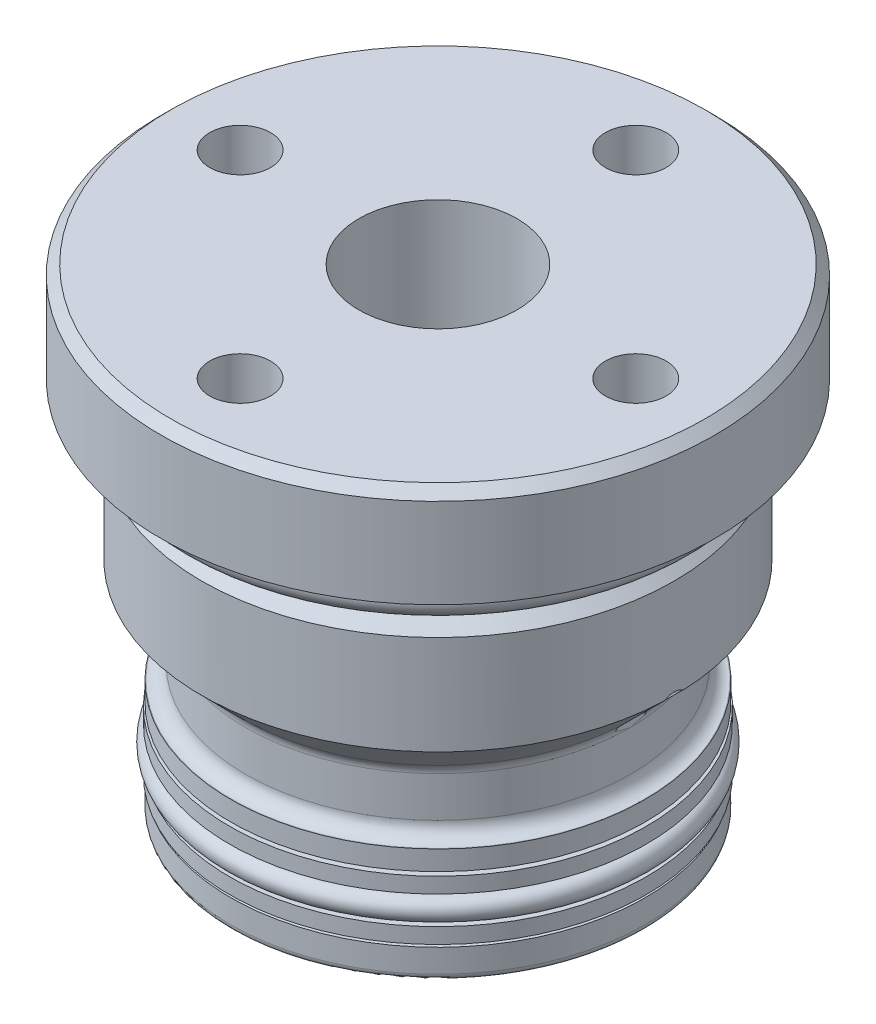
ISO-10303-21;
HEADER;
FILE_DESCRIPTION(('STEP AP214'),'2;1');
FILE_NAME('part.step','',(''),(''),'','','');
FILE_SCHEMA(('AUTOMOTIVE_DESIGN { 1 0 10303 214 1 1 1 1 }'));
ENDSEC;
DATA;
#1=APPLICATION_CONTEXT('core data for automotive mechanical design processes');
#2=APPLICATION_PROTOCOL_DEFINITION('international standard','automotive_design',2000,#1);
#3=PRODUCT_CONTEXT('',#1,'mechanical');
#4=PRODUCT('Part','Part','',(#3));
#5=PRODUCT_RELATED_PRODUCT_CATEGORY('part','',(#4));
#6=PRODUCT_DEFINITION_FORMATION('','',#4);
#7=PRODUCT_DEFINITION_CONTEXT('part definition',#1,'design');
#8=PRODUCT_DEFINITION('design','',#6,#7);
#9=PRODUCT_DEFINITION_SHAPE('','',#8);
#10=(LENGTH_UNIT() NAMED_UNIT(*) SI_UNIT(.MILLI.,.METRE.));
#11=(NAMED_UNIT(*) PLANE_ANGLE_UNIT() SI_UNIT($,.RADIAN.));
#12=(NAMED_UNIT(*) SI_UNIT($,.STERADIAN.) SOLID_ANGLE_UNIT());
#13=UNCERTAINTY_MEASURE_WITH_UNIT(LENGTH_MEASURE(1.E-05),#10,'distance_accuracy_value','');
#14=(GEOMETRIC_REPRESENTATION_CONTEXT(3) GLOBAL_UNCERTAINTY_ASSIGNED_CONTEXT((#13)) GLOBAL_UNIT_ASSIGNED_CONTEXT((#10,
#11,#12)) REPRESENTATION_CONTEXT('',''));
#15=CARTESIAN_POINT('',(0.,0.,0.));
#16=DIRECTION('',(0.,0.,1.));
#17=DIRECTION('',(1.,0.,0.));
#18=AXIS2_PLACEMENT_3D('',#15,#16,#17);
#19=CARTESIAN_POINT('',(0.,17.6149,0.));
#20=DIRECTION('',(0.,1.,0.));
#21=DIRECTION('',(0.,0.,1.));
#22=AXIS2_PLACEMENT_3D('',#19,#20,#21);
#23=CONICAL_SURFACE('',#22,18.9611,0.78539816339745);
#24=CARTESIAN_POINT('',(-19.1695202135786,17.82592,0.315721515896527));
#25=CARTESIAN_POINT('',(-19.1516331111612,17.8090378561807,0.376609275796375));
#26=CARTESIAN_POINT('',(-19.1290891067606,17.7877417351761,0.434424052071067));
#27=CARTESIAN_POINT('',(-19.0770080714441,17.738450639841,0.542787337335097));
#28=CARTESIAN_POINT('',(-19.0475572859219,17.710538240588,0.593413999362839));
#29=CARTESIAN_POINT('',(-18.9751110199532,17.6417218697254,0.70004086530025));
#30=CARTESIAN_POINT('',(-18.9305858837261,17.5993279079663,0.754003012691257));
#31=CARTESIAN_POINT('',(-18.8358684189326,17.5088442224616,0.851669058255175));
#32=CARTESIAN_POINT('',(-18.7856450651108,17.4607232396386,0.895312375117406));
#33=CARTESIAN_POINT('',(-18.6613327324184,17.3411717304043,0.987845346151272));
#34=CARTESIAN_POINT('',(-18.5855643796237,17.2679596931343,1.03216317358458));
#35=CARTESIAN_POINT('',(-18.4304938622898,17.1172513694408,1.10341036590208));
#36=CARTESIAN_POINT('',(-18.3511920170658,17.0397554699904,1.13034129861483));
#37=CARTESIAN_POINT('',(-18.1891127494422,16.8803745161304,1.16824085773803));
#38=CARTESIAN_POINT('',(-18.1062981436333,16.7984280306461,1.17878877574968));
#39=CARTESIAN_POINT('',(-17.9410040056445,16.6337450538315,1.18273368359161));
#40=CARTESIAN_POINT('',(-17.8585245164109,16.5510084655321,1.17612854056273));
#41=CARTESIAN_POINT('',(-17.7006889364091,16.3915483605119,1.14604440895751));
#42=CARTESIAN_POINT('',(-17.6252020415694,16.3147614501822,1.1235995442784));
#43=CARTESIAN_POINT('',(-17.4781891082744,16.1641917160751,1.06180964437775));
#44=CARTESIAN_POINT('',(-17.4066580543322,16.0904051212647,1.02248659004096));
#45=CARTESIAN_POINT('',(-17.2896222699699,15.9688794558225,0.939117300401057));
#46=CARTESIAN_POINT('',(-17.2424694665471,15.9196659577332,0.89953560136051));
#47=CARTESIAN_POINT('',(-17.1531680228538,15.8260426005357,0.810272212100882));
#48=CARTESIAN_POINT('',(-17.1110123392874,15.7816259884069,0.760605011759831));
#49=CARTESIAN_POINT('',(-17.0423302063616,15.7089765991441,0.66312368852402));
#50=CARTESIAN_POINT('',(-17.014411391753,15.6793397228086,0.617344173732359));
#51=CARTESIAN_POINT('',(-16.9640773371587,15.6257713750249,0.519785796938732));
#52=CARTESIAN_POINT('',(-16.9416556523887,15.6018332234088,0.468014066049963));
#53=CARTESIAN_POINT('',(-16.9066163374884,15.5643552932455,0.367791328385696));
#54=CARTESIAN_POINT('',(-16.893016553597,15.5497776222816,0.320074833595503));
#55=CARTESIAN_POINT('',(-16.8714635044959,15.5266530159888,0.22196676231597));
#56=CARTESIAN_POINT('',(-16.8635071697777,15.5181028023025,0.171576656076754));
#57=CARTESIAN_POINT('',(-16.8537493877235,15.5076144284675,0.06933792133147));
#58=CARTESIAN_POINT('',(-16.8519688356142,15.505698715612,0.0174849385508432));
#59=CARTESIAN_POINT('',(-16.8547513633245,15.5086908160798,-0.0858513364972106));
#60=CARTESIAN_POINT('',(-16.8593146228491,15.5135988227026,-0.13733461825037));
#61=CARTESIAN_POINT('',(-16.8740446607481,15.5294215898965,-0.235584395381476));
#62=CARTESIAN_POINT('',(-16.8838940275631,15.5399960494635,-0.282455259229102));
#63=CARTESIAN_POINT('',(-16.9084133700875,15.5662751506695,-0.373392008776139));
#64=CARTESIAN_POINT('',(-16.9230842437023,15.581980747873,-0.417457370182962));
#65=CARTESIAN_POINT('',(-16.9580388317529,15.6193194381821,-0.505811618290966));
#66=CARTESIAN_POINT('',(-16.9787028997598,15.6413525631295,-0.549778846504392));
#67=CARTESIAN_POINT('',(-17.024038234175,15.6895576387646,-0.633112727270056));
#68=CARTESIAN_POINT('',(-17.0487120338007,15.7157322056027,-0.672476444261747));
#69=CARTESIAN_POINT('',(-17.1156995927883,15.7865754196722,-0.766761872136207));
#70=CARTESIAN_POINT('',(-17.1602693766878,15.8335173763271,-0.818385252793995));
#71=CARTESIAN_POINT('',(-17.2548025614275,15.9325590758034,-0.91060950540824));
#72=CARTESIAN_POINT('',(-17.3047792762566,15.9846715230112,-0.95118226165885));
#73=CARTESIAN_POINT('',(-17.426737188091,16.1111560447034,-1.03443814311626));
#74=CARTESIAN_POINT('',(-17.5002539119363,16.1868871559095,-1.07280149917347));
#75=CARTESIAN_POINT('',(-17.6510912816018,16.3411427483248,-1.13210525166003));
#76=CARTESIAN_POINT('',(-17.7284137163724,16.419668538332,-1.15303736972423));
#77=CARTESIAN_POINT('',(-17.8865892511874,16.579197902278,-1.17892823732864));
#78=CARTESIAN_POINT('',(-17.9674825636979,16.6602182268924,-1.18352978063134));
#79=CARTESIAN_POINT('',(-18.129573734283,16.821491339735,-1.17628580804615));
#80=CARTESIAN_POINT('',(-18.210771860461,16.9017428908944,-1.16441719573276));
#81=CARTESIAN_POINT('',(-18.3376938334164,17.026425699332,-1.13250088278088));
#82=CARTESIAN_POINT('',(-18.3839928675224,17.0717444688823,-1.11798238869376));
#83=CARTESIAN_POINT('',(-18.4756518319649,17.1611641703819,-1.08315612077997));
#84=CARTESIAN_POINT('',(-18.5210113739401,17.205264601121,-1.06284600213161));
#85=CARTESIAN_POINT('',(-18.6101652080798,17.2916734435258,-1.01623789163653));
#86=CARTESIAN_POINT('',(-18.6539623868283,17.3339851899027,-0.989951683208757));
#87=CARTESIAN_POINT('',(-18.7393866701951,17.4162756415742,-0.931062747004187));
#88=CARTESIAN_POINT('',(-18.7810159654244,17.4562567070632,-0.898466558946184));
#89=CARTESIAN_POINT('',(-18.862533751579,17.534344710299,-0.825413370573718));
#90=CARTESIAN_POINT('',(-18.9023264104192,17.5723532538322,-0.784741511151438));
#91=CARTESIAN_POINT('',(-18.9772094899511,17.6437142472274,-0.696024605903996));
#92=CARTESIAN_POINT('',(-19.012320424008,17.6770870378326,-0.648013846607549));
#93=CARTESIAN_POINT('',(-19.0700216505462,17.7318307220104,-0.554377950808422));
#94=CARTESIAN_POINT('',(-19.0937205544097,17.7542748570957,-0.51008113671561));
#95=CARTESIAN_POINT('',(-19.1359389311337,17.7942118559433,-0.416499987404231));
#96=CARTESIAN_POINT('',(-19.1544103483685,17.811658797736,-0.367174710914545));
#97=CARTESIAN_POINT('',(-19.1695202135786,17.82592,-0.315721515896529));
#98=B_SPLINE_CURVE_WITH_KNOTS('',3,(#24,#25,#26,#27,#28,#29,#30,#31,#32,#33,#34,#35,#36,#37,#38,
#39,#40,#41,#42,#43,#44,#45,#46,#47,#48,#49,#50,#51,#52,#53,#54,#55,#56,#57,#58,#59,#60,#61,#62,
#63,#64,#65,#66,#67,#68,#69,#70,#71,#72,#73,#74,#75,#76,#77,#78,#79,#80,#81,#82,#83,#84,#85,#86,
#87,#88,#89,#90,#91,#92,#93,#94,#95,#96,#97),.UNSPECIFIED.,.F.,.F.,(4,2,2,2,2,2,2,2,2,2,2,2,2,2,
2,2,2,2,2,2,2,2,2,2,2,2,2,2,2,2,2,2,2,2,2,2,4),(0.,0.195973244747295,0.389618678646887,
0.633730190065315,0.879241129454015,1.22032849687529,1.56138510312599,1.91106303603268,
2.26078445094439,2.58956386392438,2.91791639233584,3.15360672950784,3.38896081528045,
3.57208735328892,3.75499815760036,3.90948020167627,4.06387815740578,4.2187979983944,
4.37372222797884,4.52024205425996,4.6667891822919,4.82623414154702,4.98578022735,
5.2327750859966,5.48039261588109,5.8155030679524,6.15077257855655,6.49333188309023,
6.8363720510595,7.03532842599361,7.23436546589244,7.43301340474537,7.63145655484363,
7.83613655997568,8.03988800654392,8.2043104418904,8.37019862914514),.UNSPECIFIED.);
#99=CARTESIAN_POINT('',(-18.9469741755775,17.6149,0.731766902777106));
#100=VERTEX_POINT('',#99);
#101=CARTESIAN_POINT('',(-17.9952815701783,16.6878,1.1811));
#102=VERTEX_POINT('',#101);
#103=EDGE_CURVE('E192',#100,#102,#98,.T.);
#104=ORIENTED_EDGE('',*,*,#103,.T.);
#105=CARTESIAN_POINT('',(-23.2959557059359,21.9796772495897,1.1811));
#106=CARTESIAN_POINT('',(-22.3355258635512,21.0204976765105,1.1811));
#107=CARTESIAN_POINT('',(-21.3750371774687,20.0613769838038,1.1811));
#108=CARTESIAN_POINT('',(-19.4538295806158,18.1433665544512,1.1811));
#109=CARTESIAN_POINT('',(-18.4931106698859,17.1844768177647,1.1811));
#110=CARTESIAN_POINT('',(-16.571329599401,15.2670410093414,1.1811));
#111=CARTESIAN_POINT('',(-15.610267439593,14.3084949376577,1.1811));
#112=CARTESIAN_POINT('',(-14.168229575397,12.8711216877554,1.1811));
#113=CARTESIAN_POINT('',(-13.6874761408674,12.3920715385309,1.1811));
#114=CARTESIAN_POINT('',(-12.7257592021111,11.4341820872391,1.1811));
#115=CARTESIAN_POINT('',(-12.2447956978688,10.9553427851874,1.1811));
#116=CARTESIAN_POINT('',(-11.7636962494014,10.4766400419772,1.1811));
#117=B_SPLINE_CURVE_WITH_KNOTS('',3,(#105,#106,#107,#108,#109,#110,#111,#112,#113,#114,#115,
#116),.UNSPECIFIED.,.F.,.F.,(4,2,2,2,2,4),(0.,4.07210740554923,8.14421409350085,
12.2163214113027,14.2523754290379,16.2884295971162),.UNSPECIFIED.);
#118=CARTESIAN_POINT('',(-15.7209719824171,14.4190769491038,1.1811));
#119=VERTEX_POINT('',#118);
#120=EDGE_CURVE('E273',#102,#119,#117,.T.);
#121=ORIENTED_EDGE('',*,*,#120,.T.);
#122=CARTESIAN_POINT('',(0.,14.4190769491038,0.));
#123=DIRECTION('',(0.,1.,0.));
#124=DIRECTION('',(0.,0.,1.));
#125=AXIS2_PLACEMENT_3D('',#122,#123,#124);
#126=CIRCLE('',#125,15.7652769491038);
#127=CARTESIAN_POINT('',(15.7209719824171,14.4190769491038,1.1811));
#128=VERTEX_POINT('',#127);
#129=EDGE_CURVE('E339',#119,#128,#126,.T.);
#130=ORIENTED_EDGE('',*,*,#129,.T.);
#131=CARTESIAN_POINT('',(21.8447263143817,20.530432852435,1.1811));
#132=CARTESIAN_POINT('',(20.8842080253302,19.571341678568,1.1811));
#133=CARTESIAN_POINT('',(19.9236221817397,18.612318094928,1.1811));
#134=CARTESIAN_POINT('',(18.0021625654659,16.6945600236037,1.1811));
#135=CARTESIAN_POINT('',(17.041288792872,15.7358255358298,1.1811));
#136=CARTESIAN_POINT('',(15.1190996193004,13.8187986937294,1.1811));
#137=CARTESIAN_POINT('',(14.1577842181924,12.8605063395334,1.1811));
#138=CARTESIAN_POINT('',(12.7152076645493,11.4236732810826,1.1811));
#139=CARTESIAN_POINT('',(12.2342481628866,10.9448297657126,1.1811));
#140=CARTESIAN_POINT('',(11.2720307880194,9.98744248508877,1.1811));
#141=CARTESIAN_POINT('',(10.7907729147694,9.50889871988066,1.1811));
#142=CARTESIAN_POINT('',(10.3093172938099,9.03055384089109,1.1811));
#143=B_SPLINE_CURVE_WITH_KNOTS('',3,(#131,#132,#133,#134,#135,#136,#137,#138,#139,#140,#141,
#142),.UNSPECIFIED.,.F.,.F.,(4,2,2,2,2,4),(0.,4.07210779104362,8.14421431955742,
12.2163220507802,14.2523765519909,16.2884313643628),.UNSPECIFIED.);
#144=CARTESIAN_POINT('',(17.9952815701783,16.6878,1.1811));
#145=VERTEX_POINT('',#144);
#146=EDGE_CURVE('E234',#145,#128,#143,.T.);
#147=ORIENTED_EDGE('',*,*,#146,.F.);
#148=CARTESIAN_POINT('',(19.1695202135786,17.82592,-0.315721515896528));
#149=CARTESIAN_POINT('',(19.1516331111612,17.8090378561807,-0.376609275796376));
#150=CARTESIAN_POINT('',(19.1290891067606,17.7877417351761,-0.434424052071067));
#151=CARTESIAN_POINT('',(19.0770080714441,17.738450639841,-0.542787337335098));
#152=CARTESIAN_POINT('',(19.0475572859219,17.710538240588,-0.593413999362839));
#153=CARTESIAN_POINT('',(18.9751110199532,17.6417218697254,-0.700040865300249));
#154=CARTESIAN_POINT('',(18.9305858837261,17.5993279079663,-0.754003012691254));
#155=CARTESIAN_POINT('',(18.8358684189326,17.5088442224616,-0.851669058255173));
#156=CARTESIAN_POINT('',(18.7856450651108,17.4607232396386,-0.895312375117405));
#157=CARTESIAN_POINT('',(18.6613327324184,17.3411717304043,-0.987845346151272));
#158=CARTESIAN_POINT('',(18.5855643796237,17.2679596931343,-1.03216317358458));
#159=CARTESIAN_POINT('',(18.4304938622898,17.1172513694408,-1.10341036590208));
#160=CARTESIAN_POINT('',(18.3511920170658,17.0397554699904,-1.13034129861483));
#161=CARTESIAN_POINT('',(18.1891127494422,16.8803745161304,-1.16824085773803));
#162=CARTESIAN_POINT('',(18.1062981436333,16.7984280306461,-1.17878877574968));
#163=CARTESIAN_POINT('',(17.9410040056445,16.6337450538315,-1.18273368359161));
#164=CARTESIAN_POINT('',(17.8585245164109,16.5510084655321,-1.17612854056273));
#165=CARTESIAN_POINT('',(17.7006889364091,16.3915483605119,-1.14604440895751));
#166=CARTESIAN_POINT('',(17.6252020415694,16.3147614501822,-1.1235995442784));
#167=CARTESIAN_POINT('',(17.4781891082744,16.1641917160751,-1.06180964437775));
#168=CARTESIAN_POINT('',(17.4066580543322,16.0904051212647,-1.02248659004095));
#169=CARTESIAN_POINT('',(17.2896222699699,15.9688794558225,-0.939117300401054));
#170=CARTESIAN_POINT('',(17.2424694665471,15.9196659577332,-0.899535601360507));
#171=CARTESIAN_POINT('',(17.1531680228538,15.8260426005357,-0.810272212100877));
#172=CARTESIAN_POINT('',(17.1110123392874,15.7816259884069,-0.760605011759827));
#173=CARTESIAN_POINT('',(17.0423302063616,15.7089765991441,-0.663123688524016));
#174=CARTESIAN_POINT('',(17.014411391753,15.6793397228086,-0.617344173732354));
#175=CARTESIAN_POINT('',(16.9640773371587,15.6257713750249,-0.519785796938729));
#176=CARTESIAN_POINT('',(16.9416556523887,15.6018332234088,-0.468014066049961));
#177=CARTESIAN_POINT('',(16.9066163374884,15.5643552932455,-0.367791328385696));
#178=CARTESIAN_POINT('',(16.893016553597,15.5497776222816,-0.320074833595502));
#179=CARTESIAN_POINT('',(16.8714635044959,15.5266530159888,-0.221966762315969));
#180=CARTESIAN_POINT('',(16.8635071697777,15.5181028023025,-0.171576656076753));
#181=CARTESIAN_POINT('',(16.8537493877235,15.5076144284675,-0.0693379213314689));
#182=CARTESIAN_POINT('',(16.8519688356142,15.505698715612,-0.0174849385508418));
#183=CARTESIAN_POINT('',(16.8547513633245,15.5086908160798,0.0858513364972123));
#184=CARTESIAN_POINT('',(16.8593146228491,15.5135988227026,0.137334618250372));
#185=CARTESIAN_POINT('',(16.8740446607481,15.5294215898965,0.235584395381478));
#186=CARTESIAN_POINT('',(16.8838940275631,15.5399960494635,0.282455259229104));
#187=CARTESIAN_POINT('',(16.9084133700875,15.5662751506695,0.373392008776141));
#188=CARTESIAN_POINT('',(16.9230842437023,15.581980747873,0.417457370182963));
#189=CARTESIAN_POINT('',(16.9580388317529,15.6193194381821,0.505811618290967));
#190=CARTESIAN_POINT('',(16.9787028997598,15.6413525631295,0.549778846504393));
#191=CARTESIAN_POINT('',(17.024038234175,15.6895576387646,0.633112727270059));
#192=CARTESIAN_POINT('',(17.0487120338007,15.7157322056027,0.67247644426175));
#193=CARTESIAN_POINT('',(17.1156995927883,15.7865754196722,0.766761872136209));
#194=CARTESIAN_POINT('',(17.1602693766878,15.8335173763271,0.818385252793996));
#195=CARTESIAN_POINT('',(17.2548025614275,15.9325590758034,0.910609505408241));
#196=CARTESIAN_POINT('',(17.3047792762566,15.9846715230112,0.951182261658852));
#197=CARTESIAN_POINT('',(17.426737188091,16.1111560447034,1.03443814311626));
#198=CARTESIAN_POINT('',(17.5002539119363,16.1868871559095,1.07280149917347));
#199=CARTESIAN_POINT('',(17.6510912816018,16.3411427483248,1.13210525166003));
#200=CARTESIAN_POINT('',(17.7284137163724,16.419668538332,1.15303736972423));
#201=CARTESIAN_POINT('',(17.8865892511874,16.579197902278,1.17892823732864));
#202=CARTESIAN_POINT('',(17.9674825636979,16.6602182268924,1.18352978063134));
#203=CARTESIAN_POINT('',(18.129573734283,16.821491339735,1.17628580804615));
#204=CARTESIAN_POINT('',(18.210771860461,16.9017428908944,1.16441719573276));
#205=CARTESIAN_POINT('',(18.3376938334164,17.026425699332,1.13250088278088));
#206=CARTESIAN_POINT('',(18.3839928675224,17.0717444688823,1.11798238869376));
#207=CARTESIAN_POINT('',(18.4756518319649,17.1611641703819,1.08315612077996));
#208=CARTESIAN_POINT('',(18.5210113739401,17.205264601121,1.06284600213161));
#209=CARTESIAN_POINT('',(18.6101652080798,17.2916734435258,1.01623789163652));
#210=CARTESIAN_POINT('',(18.6539623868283,17.3339851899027,0.989951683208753));
#211=CARTESIAN_POINT('',(18.7393866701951,17.4162756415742,0.931062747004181));
#212=CARTESIAN_POINT('',(18.7810159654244,17.4562567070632,0.898466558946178));
#213=CARTESIAN_POINT('',(18.8625337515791,17.534344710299,0.82541337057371));
#214=CARTESIAN_POINT('',(18.9023264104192,17.5723532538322,0.784741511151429));
#215=CARTESIAN_POINT('',(18.9772094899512,17.6437142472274,0.696024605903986));
#216=CARTESIAN_POINT('',(19.012320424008,17.6770870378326,0.64801384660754));
#217=CARTESIAN_POINT('',(19.0700216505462,17.7318307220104,0.554377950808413));
#218=CARTESIAN_POINT('',(19.0937205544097,17.7542748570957,0.510081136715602));
#219=CARTESIAN_POINT('',(19.1359389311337,17.7942118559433,0.416499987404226));
#220=CARTESIAN_POINT('',(19.1544103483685,17.811658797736,0.367174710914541));
#221=CARTESIAN_POINT('',(19.1695202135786,17.82592,0.315721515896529));
#222=B_SPLINE_CURVE_WITH_KNOTS('',3,(#148,#149,#150,#151,#152,#153,#154,#155,#156,#157,#158,
#159,#160,#161,#162,#163,#164,#165,#166,#167,#168,#169,#170,#171,#172,#173,#174,#175,#176,#177,
#178,#179,#180,#181,#182,#183,#184,#185,#186,#187,#188,#189,#190,#191,#192,#193,#194,#195,#196,
#197,#198,#199,#200,#201,#202,#203,#204,#205,#206,#207,#208,#209,#210,#211,#212,#213,#214,#215,
#216,#217,#218,#219,#220,#221),.UNSPECIFIED.,.F.,.F.,(4,2,2,2,2,2,2,2,2,2,2,2,2,2,2,2,2,2,2,2,2,
2,2,2,2,2,2,2,2,2,2,2,2,2,2,2,4),(0.,0.195973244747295,0.389618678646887,0.633730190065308,
0.879241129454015,1.22032849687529,1.56138510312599,1.91106303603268,2.26078445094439,
2.58956386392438,2.91791639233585,3.15360672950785,3.38896081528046,3.57208735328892,
3.75499815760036,3.90948020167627,4.06387815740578,4.21879799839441,4.37372222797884,
4.52024205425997,4.66678918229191,4.82623414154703,4.98578022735,5.23277508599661,
5.4803926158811,5.81550306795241,6.15077257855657,6.49333188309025,6.83637205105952,
7.03532842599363,7.23436546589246,7.43301340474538,7.63145655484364,7.83613655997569,
8.03988800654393,8.20431044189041,8.37019862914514),.UNSPECIFIED.);
#223=CARTESIAN_POINT('',(18.9469741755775,17.6149,0.731766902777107));
#224=VERTEX_POINT('',#223);
#225=EDGE_CURVE('E211',#145,#224,#222,.T.);
#226=ORIENTED_EDGE('',*,*,#225,.T.);
#227=CARTESIAN_POINT('',(0.,17.6149,0.));
#228=DIRECTION('',(0.,-1.,0.));
#229=DIRECTION('',(0.,0.,-1.));
#230=AXIS2_PLACEMENT_3D('',#227,#228,#229);
#231=CIRCLE('',#230,18.9611);
#232=EDGE_CURVE('E425',#224,#100,#231,.T.);
#233=ORIENTED_EDGE('',*,*,#232,.T.);
#234=EDGE_LOOP('',(#104,#121,#130,#147,#226,#233));
#235=FACE_BOUND('',#234,.T.);
#236=ADVANCED_FACE('F34',(#235),#23,.T.);
#237=CARTESIAN_POINT('',(0.,13.6108538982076,0.));
#238=DIRECTION('',(0.,-1.,0.));
#239=DIRECTION('',(0.,0.,-1.));
#240=AXIS2_PLACEMENT_3D('',#237,#238,#239);
#241=TOROIDAL_SURFACE('',#240,16.5735,1.143);
#242=ORIENTED_EDGE('',*,*,#129,.F.);
#243=CARTESIAN_POINT('',(-15.4332465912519,13.9381925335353,1.1811));
#244=CARTESIAN_POINT('',(-15.4148630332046,13.8768589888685,1.1811));
#245=CARTESIAN_POINT('',(-15.4016431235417,13.8139294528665,1.1811));
#246=CARTESIAN_POINT('',(-15.3859479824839,13.6866922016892,1.1811));
#247=CARTESIAN_POINT('',(-15.3834854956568,13.6223829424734,1.1811));
#248=CARTESIAN_POINT('',(-15.3893979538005,13.4942890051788,1.1811));
#249=CARTESIAN_POINT('',(-15.3977677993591,13.4305040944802,1.1811));
#250=CARTESIAN_POINT('',(-15.4250937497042,13.3052619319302,1.1811));
#251=CARTESIAN_POINT('',(-15.4440472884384,13.2438041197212,1.1811));
#252=CARTESIAN_POINT('',(-15.4919990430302,13.1249183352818,1.1811));
#253=CARTESIAN_POINT('',(-15.521000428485,13.0674916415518,1.1811));
#254=CARTESIAN_POINT('',(-15.5882153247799,12.9583070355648,1.1811));
#255=CARTESIAN_POINT('',(-15.6264292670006,12.9065493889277,1.1811));
#256=CARTESIAN_POINT('',(-15.7110619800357,12.8100614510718,1.1811));
#257=CARTESIAN_POINT('',(-15.7574969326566,12.765345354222,1.1811));
#258=CARTESIAN_POINT('',(-15.8571968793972,12.684317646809,1.1811));
#259=CARTESIAN_POINT('',(-15.9104619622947,12.6480061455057,1.1811));
#260=CARTESIAN_POINT('',(-16.0224677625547,12.5847132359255,1.1811));
#261=CARTESIAN_POINT('',(-16.0812231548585,12.5577577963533,1.1811));
#262=CARTESIAN_POINT('',(-16.2024188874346,12.5140695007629,1.1811));
#263=CARTESIAN_POINT('',(-16.2648592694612,12.497336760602,1.1811));
#264=CARTESIAN_POINT('',(-16.3917966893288,12.4745368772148,1.1811));
#265=CARTESIAN_POINT('',(-16.4562978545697,12.4684927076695,1.1811));
#266=CARTESIAN_POINT('',(-16.5854003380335,12.4673112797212,1.1811));
#267=CARTESIAN_POINT('',(-16.6500016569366,12.4721740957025,1.1811));
#268=CARTESIAN_POINT('',(-16.7775124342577,12.4926793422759,1.1811));
#269=CARTESIAN_POINT('',(-16.8404208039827,12.508328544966,1.1811));
#270=CARTESIAN_POINT('',(-16.9627131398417,12.5499767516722,1.1811));
#271=CARTESIAN_POINT('',(-17.022097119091,12.5759757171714,1.1811));
#272=CARTESIAN_POINT('',(-17.1355882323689,12.6375619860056,1.1811));
#273=CARTESIAN_POINT('',(-17.1897006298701,12.6731395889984,1.1811));
#274=CARTESIAN_POINT('',(-17.2911683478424,12.7528921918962,1.1811));
#275=CARTESIAN_POINT('',(-17.3385237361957,12.7970671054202,1.1811));
#276=CARTESIAN_POINT('',(-17.425027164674,12.8926632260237,1.1811));
#277=CARTESIAN_POINT('',(-17.4641920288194,12.9440692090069,1.1811));
#278=CARTESIAN_POINT('',(-17.5333126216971,13.0527389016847,1.1811));
#279=CARTESIAN_POINT('',(-17.5632684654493,13.1100025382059,1.1811));
#280=CARTESIAN_POINT('',(-17.6130516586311,13.2286242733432,1.1811));
#281=CARTESIAN_POINT('',(-17.6329014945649,13.2899729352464,1.1811));
#282=CARTESIAN_POINT('',(-17.662002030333,13.4151345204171,1.1811));
#283=CARTESIAN_POINT('',(-17.6712528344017,13.478947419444,1.1811));
#284=CARTESIAN_POINT('',(-17.6788828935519,13.6071211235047,1.1811));
#285=CARTESIAN_POINT('',(-17.6772788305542,13.671480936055,1.1811));
#286=CARTESIAN_POINT('',(-17.6632847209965,13.7990167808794,1.1811));
#287=CARTESIAN_POINT('',(-17.6508947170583,13.8621928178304,1.1811));
#288=CARTESIAN_POINT('',(-17.6156901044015,13.9855497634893,1.1811));
#289=CARTESIAN_POINT('',(-17.5928785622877,14.0457315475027,1.1811));
#290=CARTESIAN_POINT('',(-17.5374858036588,14.1614168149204,1.1811));
#291=CARTESIAN_POINT('',(-17.5049045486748,14.2169202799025,1.1811));
#292=CARTESIAN_POINT('',(-17.4308645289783,14.3217382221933,1.1811));
#293=CARTESIAN_POINT('',(-17.3893965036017,14.3710461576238,1.1811));
#294=CARTESIAN_POINT('',(-17.2987860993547,14.4620176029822,1.1811));
#295=CARTESIAN_POINT('',(-17.2496436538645,14.5036810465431,1.1811));
#296=CARTESIAN_POINT('',(-17.1449740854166,14.5782721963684,1.1811));
#297=CARTESIAN_POINT('',(-17.0894342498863,14.6111820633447,1.1811));
#298=CARTESIAN_POINT('',(-16.9736271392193,14.6672346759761,1.1811));
#299=CARTESIAN_POINT('',(-16.9133597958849,14.6903772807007,1.1811));
#300=CARTESIAN_POINT('',(-16.7896627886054,14.7262917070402,1.1811));
#301=CARTESIAN_POINT('',(-16.7262262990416,14.7390400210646,1.1811));
#302=CARTESIAN_POINT('',(-16.5981137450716,14.7537241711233,1.1811));
#303=CARTESIAN_POINT('',(-16.5334376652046,14.7556598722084,1.1811));
#304=CARTESIAN_POINT('',(-16.4045726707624,14.7486609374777,1.1811));
#305=CARTESIAN_POINT('',(-16.340384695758,14.7397089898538,1.1811));
#306=CARTESIAN_POINT('',(-16.2144242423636,14.7111579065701,1.1811));
#307=CARTESIAN_POINT('',(-16.1526516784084,14.6915591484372,1.1811));
#308=CARTESIAN_POINT('',(-16.0332744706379,14.6422647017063,1.1811));
#309=CARTESIAN_POINT('',(-15.9756699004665,14.612568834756,1.1811));
#310=CARTESIAN_POINT('',(-15.8662589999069,14.5439041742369,1.1811));
#311=CARTESIAN_POINT('',(-15.8144540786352,14.5049331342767,1.1811));
#312=CARTESIAN_POINT('',(-15.7182000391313,14.4188763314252,1.1811));
#313=CARTESIAN_POINT('',(-15.6737430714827,14.3717993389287,1.1811));
#314=CARTESIAN_POINT('',(-15.59343424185,14.2708665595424,1.1811));
#315=CARTESIAN_POINT('',(-15.5575719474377,14.2170191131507,1.1811));
#316=CARTESIAN_POINT('',(-15.5071015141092,14.125288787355,1.1811));
#317=CARTESIAN_POINT('',(-15.48956461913,14.0889846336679,1.1811));
#318=CARTESIAN_POINT('',(-15.458419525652,14.0147283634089,1.1811));
#319=CARTESIAN_POINT('',(-15.4448113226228,13.9767762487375,1.1811));
#320=CARTESIAN_POINT('',(-15.4332465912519,13.9381925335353,1.1811));
#321=B_SPLINE_CURVE_WITH_KNOTS('',3,(#243,#244,#245,#246,#247,#248,#249,#250,#251,#252,#253,
#254,#255,#256,#257,#258,#259,#260,#261,#262,#263,#264,#265,#266,#267,#268,#269,#270,#271,#272,
#273,#274,#275,#276,#277,#278,#279,#280,#281,#282,#283,#284,#285,#286,#287,#288,#289,#290,#291,
#292,#293,#294,#295,#296,#297,#298,#299,#300,#301,#302,#303,#304,#305,#306,#307,#308,#309,#310,
#311,#312,#313,#314,#315,#316,#317,#318,#319,#320),.UNSPECIFIED.,.T.,.F.,(4,2,2,2,2,2,2,2,2,2,2,
2,2,2,2,2,2,2,2,2,2,2,2,2,2,2,2,2,2,2,2,2,2,2,2,2,2,2,4),(0.,0.191941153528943,0.38410964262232,
0.576187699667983,0.768219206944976,0.960311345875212,1.1524124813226,1.34489602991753,
1.53738208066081,1.73039820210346,1.92341651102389,2.11684918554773,2.31028317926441,
2.50383872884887,2.69739355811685,2.89075310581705,3.08411071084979,3.27706715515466,
3.47002118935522,3.66254399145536,3.85506490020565,4.04729000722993,4.2395143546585,
4.43168217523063,4.6238507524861,4.81622056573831,5.00859204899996,5.20135262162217,
5.39411597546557,5.58731408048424,5.7805145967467,5.97402271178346,6.16752396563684,
6.3610286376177,6.55458022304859,6.74792369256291,6.94103127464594,7.06177778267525,
7.18252415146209),.UNSPECIFIED.);
#322=CARTESIAN_POINT('',(-15.4305,13.9288867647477,1.1811));
#323=VERTEX_POINT('',#322);
#324=EDGE_CURVE('E252',#119,#323,#321,.T.);
#325=ORIENTED_EDGE('',*,*,#324,.T.);
#326=CARTESIAN_POINT('',(-15.4305,13.6108538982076,0.));
#327=CARTESIAN_POINT('',(-15.4305,13.613028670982,0.00799063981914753));
#328=CARTESIAN_POINT('',(-15.4305,13.6152034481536,0.0159812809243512));
#329=CARTESIAN_POINT('',(-15.4305,13.7174669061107,0.391725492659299));
#330=CARTESIAN_POINT('',(-15.4305,13.8175078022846,0.759496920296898));
#331=CARTESIAN_POINT('',(-15.4305,13.9635189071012,1.31209283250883));
#332=CARTESIAN_POINT('',(-15.4305,14.0114975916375,1.49638101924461));
#333=CARTESIAN_POINT('',(-15.4305,14.1054322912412,1.86554876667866));
#334=CARTESIAN_POINT('',(-15.4305,14.1513874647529,2.05042853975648));
#335=CARTESIAN_POINT('',(-15.4305,14.2857301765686,2.60867046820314));
#336=CARTESIAN_POINT('',(-15.4305,14.3699018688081,2.9830929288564));
#337=CARTESIAN_POINT('',(-15.4305,14.482339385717,3.54722578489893));
#338=CARTESIAN_POINT('',(-15.4305,14.5174960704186,3.73555815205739));
#339=CARTESIAN_POINT('',(-15.4305,14.5821209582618,4.11324652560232));
#340=CARTESIAN_POINT('',(-15.4305,14.6115881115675,4.30260271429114));
#341=CARTESIAN_POINT('',(-15.4305,14.663758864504,4.68405634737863));
#342=CARTESIAN_POINT('',(-15.4305,14.6863968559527,4.87616289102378));
#343=CARTESIAN_POINT('',(-15.4305,14.7228511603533,5.26115023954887));
#344=CARTESIAN_POINT('',(-15.4305,14.7366722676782,5.45403056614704));
#345=CARTESIAN_POINT('',(-15.4305,14.7491652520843,5.74425114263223));
#346=CARTESIAN_POINT('',(-15.4305,14.751952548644,5.84141866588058));
#347=CARTESIAN_POINT('',(-15.4305,14.7543775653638,6.0357851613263));
#348=CARTESIAN_POINT('',(-15.4305,14.754015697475,6.13298412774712));
#349=CARTESIAN_POINT('',(-15.4305,14.7497261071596,6.32749297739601));
#350=CARTESIAN_POINT('',(-15.4305,14.7457917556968,6.42480273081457));
#351=CARTESIAN_POINT('',(-15.4305,14.7337982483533,6.61920862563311));
#352=CARTESIAN_POINT('',(-15.4305,14.7257371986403,6.7163046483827));
#353=CARTESIAN_POINT('',(-15.4305,14.7153393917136,6.81317717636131));
#354=B_SPLINE_CURVE_WITH_KNOTS('',3,(#326,#327,#328,#329,#330,#331,#332,#333,#334,#335,#336,
#337,#338,#339,#340,#341,#342,#343,#344,#345,#346,#347,#348,#349,#350,#351,#352,#353),
.UNSPECIFIED.,.F.,.F.,(4,2,2,2,2,2,2,2,2,2,2,2,2,4),(0.,0.0248439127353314,1.16823499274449,
1.73951688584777,2.31103416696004,3.46197244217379,4.03666336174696,4.61146022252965,
5.19161515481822,5.77145434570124,6.06303530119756,6.35457811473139,6.64666301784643,
6.93888208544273),.UNSPECIFIED.);
#355=CARTESIAN_POINT('',(-15.4305,13.6108538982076,0.));
#356=VERTEX_POINT('',#355);
#357=EDGE_CURVE('E319',#356,#323,#354,.T.);
#358=ORIENTED_EDGE('',*,*,#357,.F.);
#359=CARTESIAN_POINT('',(0.,13.6108538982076,0.));
#360=DIRECTION('',(0.,-1.,0.));
#361=DIRECTION('',(0.,0.,-1.));
#362=AXIS2_PLACEMENT_3D('',#359,#360,#361);
#363=CIRCLE('',#362,15.4305);
#364=CARTESIAN_POINT('',(15.4305,13.6108538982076,0.));
#365=VERTEX_POINT('',#364);
#366=EDGE_CURVE('E331',#365,#356,#363,.T.);
#367=ORIENTED_EDGE('',*,*,#366,.F.);
#368=CARTESIAN_POINT('',(15.4305,13.6108538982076,0.));
#369=CARTESIAN_POINT('',(15.4305,13.613028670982,0.00799063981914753));
#370=CARTESIAN_POINT('',(15.4305,13.6152034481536,0.0159812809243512));
#371=CARTESIAN_POINT('',(15.4305,13.7174669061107,0.391725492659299));
#372=CARTESIAN_POINT('',(15.4305,13.8175078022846,0.759496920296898));
#373=CARTESIAN_POINT('',(15.4305,13.9635189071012,1.31209283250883));
#374=CARTESIAN_POINT('',(15.4305,14.0114975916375,1.49638101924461));
#375=CARTESIAN_POINT('',(15.4305,14.1054322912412,1.86554876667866));
#376=CARTESIAN_POINT('',(15.4305,14.1513874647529,2.05042853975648));
#377=CARTESIAN_POINT('',(15.4305,14.2857301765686,2.60867046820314));
#378=CARTESIAN_POINT('',(15.4305,14.3699018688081,2.9830929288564));
#379=CARTESIAN_POINT('',(15.4305,14.482339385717,3.54722578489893));
#380=CARTESIAN_POINT('',(15.4305,14.5174960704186,3.73555815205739));
#381=CARTESIAN_POINT('',(15.4305,14.5821209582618,4.11324652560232));
#382=CARTESIAN_POINT('',(15.4305,14.6115881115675,4.30260271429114));
#383=CARTESIAN_POINT('',(15.4305,14.663758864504,4.68405634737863));
#384=CARTESIAN_POINT('',(15.4305,14.6863968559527,4.87616289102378));
#385=CARTESIAN_POINT('',(15.4305,14.7228511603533,5.26115023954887));
#386=CARTESIAN_POINT('',(15.4305,14.7366722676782,5.45403056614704));
#387=CARTESIAN_POINT('',(15.4305,14.7491652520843,5.74425114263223));
#388=CARTESIAN_POINT('',(15.4305,14.751952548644,5.84141866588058));
#389=CARTESIAN_POINT('',(15.4305,14.7543775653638,6.0357851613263));
#390=CARTESIAN_POINT('',(15.4305,14.754015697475,6.13298412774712));
#391=CARTESIAN_POINT('',(15.4305,14.7497261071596,6.32749297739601));
#392=CARTESIAN_POINT('',(15.4305,14.7457917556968,6.42480273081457));
#393=CARTESIAN_POINT('',(15.4305,14.7337982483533,6.61920862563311));
#394=CARTESIAN_POINT('',(15.4305,14.7257371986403,6.7163046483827));
#395=CARTESIAN_POINT('',(15.4305,14.7153393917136,6.81317717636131));
#396=B_SPLINE_CURVE_WITH_KNOTS('',3,(#368,#369,#370,#371,#372,#373,#374,#375,#376,#377,#378,
#379,#380,#381,#382,#383,#384,#385,#386,#387,#388,#389,#390,#391,#392,#393,#394,#395),
.UNSPECIFIED.,.F.,.F.,(4,2,2,2,2,2,2,2,2,2,2,2,2,4),(0.,0.0248439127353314,1.16823499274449,
1.73951688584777,2.31103416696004,3.46197244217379,4.03666336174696,4.61146022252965,
5.19161515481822,5.77145434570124,6.06303530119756,6.35457811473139,6.64666301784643,
6.93888208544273),.UNSPECIFIED.);
#397=CARTESIAN_POINT('',(15.4305,13.9288867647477,1.1811));
#398=VERTEX_POINT('',#397);
#399=EDGE_CURVE('E283',#398,#365,#396,.F.);
#400=ORIENTED_EDGE('',*,*,#399,.F.);
#401=CARTESIAN_POINT('',(15.4332465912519,13.9381925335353,1.1811));
#402=CARTESIAN_POINT('',(15.4148630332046,13.8768589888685,1.1811));
#403=CARTESIAN_POINT('',(15.4016431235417,13.8139294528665,1.1811));
#404=CARTESIAN_POINT('',(15.3859479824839,13.6866922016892,1.1811));
#405=CARTESIAN_POINT('',(15.3834854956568,13.6223829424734,1.1811));
#406=CARTESIAN_POINT('',(15.3893979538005,13.4942890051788,1.1811));
#407=CARTESIAN_POINT('',(15.3977677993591,13.4305040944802,1.1811));
#408=CARTESIAN_POINT('',(15.4250937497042,13.3052619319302,1.1811));
#409=CARTESIAN_POINT('',(15.4440472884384,13.2438041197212,1.1811));
#410=CARTESIAN_POINT('',(15.4919990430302,13.1249183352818,1.1811));
#411=CARTESIAN_POINT('',(15.521000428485,13.0674916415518,1.1811));
#412=CARTESIAN_POINT('',(15.5882153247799,12.9583070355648,1.1811));
#413=CARTESIAN_POINT('',(15.6264292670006,12.9065493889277,1.1811));
#414=CARTESIAN_POINT('',(15.7110619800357,12.8100614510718,1.1811));
#415=CARTESIAN_POINT('',(15.7574969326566,12.765345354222,1.1811));
#416=CARTESIAN_POINT('',(15.8571968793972,12.684317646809,1.1811));
#417=CARTESIAN_POINT('',(15.9104619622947,12.6480061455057,1.1811));
#418=CARTESIAN_POINT('',(16.0224677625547,12.5847132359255,1.1811));
#419=CARTESIAN_POINT('',(16.0812231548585,12.5577577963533,1.1811));
#420=CARTESIAN_POINT('',(16.2024188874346,12.5140695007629,1.1811));
#421=CARTESIAN_POINT('',(16.2648592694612,12.497336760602,1.1811));
#422=CARTESIAN_POINT('',(16.3917966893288,12.4745368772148,1.1811));
#423=CARTESIAN_POINT('',(16.4562978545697,12.4684927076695,1.1811));
#424=CARTESIAN_POINT('',(16.5854003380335,12.4673112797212,1.1811));
#425=CARTESIAN_POINT('',(16.6500016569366,12.4721740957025,1.1811));
#426=CARTESIAN_POINT('',(16.7775124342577,12.4926793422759,1.1811));
#427=CARTESIAN_POINT('',(16.8404208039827,12.508328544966,1.1811));
#428=CARTESIAN_POINT('',(16.9627131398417,12.5499767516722,1.1811));
#429=CARTESIAN_POINT('',(17.022097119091,12.5759757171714,1.1811));
#430=CARTESIAN_POINT('',(17.1355882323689,12.6375619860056,1.1811));
#431=CARTESIAN_POINT('',(17.1897006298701,12.6731395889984,1.1811));
#432=CARTESIAN_POINT('',(17.2911683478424,12.7528921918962,1.1811));
#433=CARTESIAN_POINT('',(17.3385237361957,12.7970671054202,1.1811));
#434=CARTESIAN_POINT('',(17.425027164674,12.8926632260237,1.1811));
#435=CARTESIAN_POINT('',(17.4641920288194,12.9440692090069,1.1811));
#436=CARTESIAN_POINT('',(17.5333126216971,13.0527389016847,1.1811));
#437=CARTESIAN_POINT('',(17.5632684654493,13.1100025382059,1.1811));
#438=CARTESIAN_POINT('',(17.6130516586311,13.2286242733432,1.1811));
#439=CARTESIAN_POINT('',(17.6329014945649,13.2899729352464,1.1811));
#440=CARTESIAN_POINT('',(17.662002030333,13.4151345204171,1.1811));
#441=CARTESIAN_POINT('',(17.6712528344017,13.478947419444,1.1811));
#442=CARTESIAN_POINT('',(17.6788828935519,13.6071211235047,1.1811));
#443=CARTESIAN_POINT('',(17.6772788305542,13.671480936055,1.1811));
#444=CARTESIAN_POINT('',(17.6632847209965,13.7990167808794,1.1811));
#445=CARTESIAN_POINT('',(17.6508947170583,13.8621928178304,1.1811));
#446=CARTESIAN_POINT('',(17.6156901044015,13.9855497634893,1.1811));
#447=CARTESIAN_POINT('',(17.5928785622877,14.0457315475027,1.1811));
#448=CARTESIAN_POINT('',(17.5374858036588,14.1614168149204,1.1811));
#449=CARTESIAN_POINT('',(17.5049045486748,14.2169202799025,1.1811));
#450=CARTESIAN_POINT('',(17.4308645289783,14.3217382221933,1.1811));
#451=CARTESIAN_POINT('',(17.3893965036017,14.3710461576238,1.1811));
#452=CARTESIAN_POINT('',(17.2987860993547,14.4620176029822,1.1811));
#453=CARTESIAN_POINT('',(17.2496436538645,14.5036810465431,1.1811));
#454=CARTESIAN_POINT('',(17.1449740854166,14.5782721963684,1.1811));
#455=CARTESIAN_POINT('',(17.0894342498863,14.6111820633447,1.1811));
#456=CARTESIAN_POINT('',(16.9736271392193,14.6672346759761,1.1811));
#457=CARTESIAN_POINT('',(16.9133597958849,14.6903772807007,1.1811));
#458=CARTESIAN_POINT('',(16.7896627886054,14.7262917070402,1.1811));
#459=CARTESIAN_POINT('',(16.7262262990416,14.7390400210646,1.1811));
#460=CARTESIAN_POINT('',(16.5981137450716,14.7537241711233,1.1811));
#461=CARTESIAN_POINT('',(16.5334376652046,14.7556598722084,1.1811));
#462=CARTESIAN_POINT('',(16.4045726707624,14.7486609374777,1.1811));
#463=CARTESIAN_POINT('',(16.340384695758,14.7397089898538,1.1811));
#464=CARTESIAN_POINT('',(16.2144242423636,14.7111579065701,1.1811));
#465=CARTESIAN_POINT('',(16.1526516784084,14.6915591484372,1.1811));
#466=CARTESIAN_POINT('',(16.0332744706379,14.6422647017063,1.1811));
#467=CARTESIAN_POINT('',(15.9756699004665,14.612568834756,1.1811));
#468=CARTESIAN_POINT('',(15.8662589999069,14.5439041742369,1.1811));
#469=CARTESIAN_POINT('',(15.8144540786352,14.5049331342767,1.1811));
#470=CARTESIAN_POINT('',(15.7182000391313,14.4188763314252,1.1811));
#471=CARTESIAN_POINT('',(15.6737430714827,14.3717993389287,1.1811));
#472=CARTESIAN_POINT('',(15.59343424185,14.2708665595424,1.1811));
#473=CARTESIAN_POINT('',(15.5575719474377,14.2170191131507,1.1811));
#474=CARTESIAN_POINT('',(15.5071015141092,14.125288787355,1.1811));
#475=CARTESIAN_POINT('',(15.48956461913,14.0889846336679,1.1811));
#476=CARTESIAN_POINT('',(15.458419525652,14.0147283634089,1.1811));
#477=CARTESIAN_POINT('',(15.4448113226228,13.9767762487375,1.1811));
#478=CARTESIAN_POINT('',(15.4332465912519,13.9381925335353,1.1811));
#479=B_SPLINE_CURVE_WITH_KNOTS('',3,(#401,#402,#403,#404,#405,#406,#407,#408,#409,#410,#411,
#412,#413,#414,#415,#416,#417,#418,#419,#420,#421,#422,#423,#424,#425,#426,#427,#428,#429,#430,
#431,#432,#433,#434,#435,#436,#437,#438,#439,#440,#441,#442,#443,#444,#445,#446,#447,#448,#449,
#450,#451,#452,#453,#454,#455,#456,#457,#458,#459,#460,#461,#462,#463,#464,#465,#466,#467,#468,
#469,#470,#471,#472,#473,#474,#475,#476,#477,#478),.UNSPECIFIED.,.T.,.F.,(4,2,2,2,2,2,2,2,2,2,2,
2,2,2,2,2,2,2,2,2,2,2,2,2,2,2,2,2,2,2,2,2,2,2,2,2,2,2,4),(0.,0.191941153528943,0.38410964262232,
0.576187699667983,0.768219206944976,0.960311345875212,1.1524124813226,1.34489602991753,
1.53738208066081,1.73039820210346,1.92341651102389,2.11684918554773,2.31028317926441,
2.50383872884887,2.69739355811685,2.89075310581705,3.08411071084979,3.27706715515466,
3.47002118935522,3.66254399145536,3.85506490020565,4.04729000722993,4.2395143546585,
4.43168217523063,4.6238507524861,4.81622056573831,5.00859204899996,5.20135262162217,
5.39411597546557,5.58731408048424,5.7805145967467,5.97402271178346,6.16752396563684,
6.3610286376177,6.55458022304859,6.74792369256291,6.94103127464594,7.06177778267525,
7.18252415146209),.UNSPECIFIED.);
#480=EDGE_CURVE('E307',#128,#398,#479,.T.);
#481=ORIENTED_EDGE('',*,*,#480,.F.);
#482=EDGE_LOOP('',(#242,#325,#358,#367,#400,#481));
#483=FACE_BOUND('',#482,.T.);
#484=ADVANCED_FACE('F220',(#483),#241,.F.);
#485=CARTESIAN_POINT('',(15.7209719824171,14.4190769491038,-1.1811));
#486=VERTEX_POINT('',#485);
#487=CARTESIAN_POINT('',(-15.7209719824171,14.4190769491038,-1.1811));
#488=VERTEX_POINT('',#487);
#489=EDGE_CURVE('E340',#486,#488,#126,.T.);
#490=ORIENTED_EDGE('',*,*,#489,.T.);
#491=CARTESIAN_POINT('',(-11.7636962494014,10.4766400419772,-1.1811));
#492=CARTESIAN_POINT('',(-12.2447956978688,10.9553427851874,-1.1811));
#493=CARTESIAN_POINT('',(-12.7257592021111,11.4341820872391,-1.1811));
#494=CARTESIAN_POINT('',(-13.6874761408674,12.3920715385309,-1.1811));
#495=CARTESIAN_POINT('',(-14.168229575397,12.8711216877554,-1.1811));
#496=CARTESIAN_POINT('',(-15.610267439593,14.3084949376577,-1.1811));
#497=CARTESIAN_POINT('',(-16.571329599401,15.2670410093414,-1.1811));
#498=CARTESIAN_POINT('',(-18.4931106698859,17.1844768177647,-1.1811));
#499=CARTESIAN_POINT('',(-19.4538295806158,18.1433665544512,-1.1811));
#500=CARTESIAN_POINT('',(-21.3750371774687,20.0613769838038,-1.1811));
#501=CARTESIAN_POINT('',(-22.3355258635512,21.0204976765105,-1.1811));
#502=CARTESIAN_POINT('',(-23.2959557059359,21.9796772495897,-1.1811));
#503=B_SPLINE_CURVE_WITH_KNOTS('',3,(#491,#492,#493,#494,#495,#496,#497,#498,#499,#500,#501,
#502),.UNSPECIFIED.,.F.,.F.,(4,2,2,2,2,4),(0.,2.03605416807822,4.07210818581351,8.1442155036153,
12.2163221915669,16.2884295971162),.UNSPECIFIED.);
#504=CARTESIAN_POINT('',(-17.9952815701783,16.6878,-1.1811));
#505=VERTEX_POINT('',#504);
#506=EDGE_CURVE('E245',#488,#505,#503,.T.);
#507=ORIENTED_EDGE('',*,*,#506,.T.);
#508=CARTESIAN_POINT('',(-18.9469741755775,17.6149,-0.731766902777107));
#509=VERTEX_POINT('',#508);
#510=EDGE_CURVE('E148',#505,#509,#98,.T.);
#511=ORIENTED_EDGE('',*,*,#510,.T.);
#512=CARTESIAN_POINT('',(18.9469741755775,17.6149,-0.731766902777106));
#513=VERTEX_POINT('',#512);
#514=EDGE_CURVE('E429',#509,#513,#231,.T.);
#515=ORIENTED_EDGE('',*,*,#514,.T.);
#516=CARTESIAN_POINT('',(17.9952815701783,16.6878,-1.1811));
#517=VERTEX_POINT('',#516);
#518=EDGE_CURVE('E205',#513,#517,#222,.T.);
#519=ORIENTED_EDGE('',*,*,#518,.T.);
#520=CARTESIAN_POINT('',(10.3093172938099,9.03055384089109,-1.1811));
#521=CARTESIAN_POINT('',(10.7907729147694,9.50889871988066,-1.1811));
#522=CARTESIAN_POINT('',(11.2720307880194,9.98744248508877,-1.1811));
#523=CARTESIAN_POINT('',(12.2342481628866,10.9448297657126,-1.1811));
#524=CARTESIAN_POINT('',(12.7152076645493,11.4236732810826,-1.1811));
#525=CARTESIAN_POINT('',(14.1577842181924,12.8605063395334,-1.1811));
#526=CARTESIAN_POINT('',(15.1190996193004,13.8187986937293,-1.1811));
#527=CARTESIAN_POINT('',(17.041288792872,15.7358255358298,-1.1811));
#528=CARTESIAN_POINT('',(18.0021625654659,16.6945600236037,-1.1811));
#529=CARTESIAN_POINT('',(19.9236221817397,18.612318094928,-1.1811));
#530=CARTESIAN_POINT('',(20.8842080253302,19.571341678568,-1.1811));
#531=CARTESIAN_POINT('',(21.8447263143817,20.530432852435,-1.1811));
#532=B_SPLINE_CURVE_WITH_KNOTS('',3,(#520,#521,#522,#523,#524,#525,#526,#527,#528,#529,#530,
#531),.UNSPECIFIED.,.F.,.F.,(4,2,2,2,2,4),(0.,2.03605481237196,4.07210931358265,
8.14421704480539,12.2163235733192,16.2884313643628),.UNSPECIFIED.);
#533=EDGE_CURVE('E240',#486,#517,#532,.T.);
#534=ORIENTED_EDGE('',*,*,#533,.F.);
#535=EDGE_LOOP('',(#490,#507,#511,#515,#519,#534));
#536=FACE_BOUND('',#535,.T.);
#537=ADVANCED_FACE('F216',(#536),#23,.T.);
#538=CARTESIAN_POINT('',(-15.4305,13.6108538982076,0.));
#539=CARTESIAN_POINT('',(-15.4305,13.613028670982,-0.00799063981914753));
#540=CARTESIAN_POINT('',(-15.4305,13.6152034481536,-0.0159812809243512));
#541=CARTESIAN_POINT('',(-15.4305,13.7174669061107,-0.391725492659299));
#542=CARTESIAN_POINT('',(-15.4305,13.8175078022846,-0.759496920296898));
#543=CARTESIAN_POINT('',(-15.4305,13.9635189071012,-1.31209283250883));
#544=CARTESIAN_POINT('',(-15.4305,14.0114975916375,-1.49638101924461));
#545=CARTESIAN_POINT('',(-15.4305,14.1054322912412,-1.86554876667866));
#546=CARTESIAN_POINT('',(-15.4305,14.1513874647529,-2.05042853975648));
#547=CARTESIAN_POINT('',(-15.4305,14.2857301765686,-2.60867046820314));
#548=CARTESIAN_POINT('',(-15.4305,14.3699018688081,-2.9830929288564));
#549=CARTESIAN_POINT('',(-15.4305,14.482339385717,-3.54722578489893));
#550=CARTESIAN_POINT('',(-15.4305,14.5174960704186,-3.73555815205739));
#551=CARTESIAN_POINT('',(-15.4305,14.5821209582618,-4.11324652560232));
#552=CARTESIAN_POINT('',(-15.4305,14.6115881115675,-4.30260271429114));
#553=CARTESIAN_POINT('',(-15.4305,14.663758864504,-4.68405634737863));
#554=CARTESIAN_POINT('',(-15.4305,14.6863968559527,-4.87616289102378));
#555=CARTESIAN_POINT('',(-15.4305,14.7228511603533,-5.26115023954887));
#556=CARTESIAN_POINT('',(-15.4305,14.7366722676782,-5.45403056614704));
#557=CARTESIAN_POINT('',(-15.4305,14.7491652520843,-5.74425114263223));
#558=CARTESIAN_POINT('',(-15.4305,14.751952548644,-5.84141866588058));
#559=CARTESIAN_POINT('',(-15.4305,14.7543775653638,-6.0357851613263));
#560=CARTESIAN_POINT('',(-15.4305,14.754015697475,-6.13298412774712));
#561=CARTESIAN_POINT('',(-15.4305,14.7497261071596,-6.32749297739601));
#562=CARTESIAN_POINT('',(-15.4305,14.7457917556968,-6.42480273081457));
#563=CARTESIAN_POINT('',(-15.4305,14.7337982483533,-6.61920862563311));
#564=CARTESIAN_POINT('',(-15.4305,14.7257371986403,-6.7163046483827));
#565=CARTESIAN_POINT('',(-15.4305,14.7153393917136,-6.81317717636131));
#566=B_SPLINE_CURVE_WITH_KNOTS('',3,(#538,#539,#540,#541,#542,#543,#544,#545,#546,#547,#548,
#549,#550,#551,#552,#553,#554,#555,#556,#557,#558,#559,#560,#561,#562,#563,#564,#565),
.UNSPECIFIED.,.F.,.F.,(4,2,2,2,2,2,2,2,2,2,2,2,2,4),(0.,0.0248439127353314,1.16823499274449,
1.73951688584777,2.31103416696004,3.46197244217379,4.03666336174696,4.61146022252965,
5.19161515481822,5.77145434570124,6.06303530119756,6.35457811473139,6.64666301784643,
6.93888208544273),.UNSPECIFIED.);
#567=CARTESIAN_POINT('',(-15.4305,13.9288867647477,-1.1811));
#568=VERTEX_POINT('',#567);
#569=EDGE_CURVE('E142',#568,#356,#566,.F.);
#570=ORIENTED_EDGE('',*,*,#569,.F.);
#571=CARTESIAN_POINT('',(-15.4332465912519,13.9381925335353,-1.1811));
#572=CARTESIAN_POINT('',(-15.4516789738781,13.9996689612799,-1.1811));
#573=CARTESIAN_POINT('',(-15.4753262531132,14.0596312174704,-1.1811));
#574=CARTESIAN_POINT('',(-15.5323804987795,14.1747795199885,-1.1811));
#575=CARTESIAN_POINT('',(-15.5657993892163,14.2299596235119,-1.1811));
#576=CARTESIAN_POINT('',(-15.6414065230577,14.3339007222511,-1.1811));
#577=CARTESIAN_POINT('',(-15.6835895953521,14.3826654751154,-1.1811));
#578=CARTESIAN_POINT('',(-15.7755176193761,14.4724241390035,-1.1811));
#579=CARTESIAN_POINT('',(-15.8252607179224,14.5134199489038,-1.1811));
#580=CARTESIAN_POINT('',(-15.9310136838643,14.5865882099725,-1.1811));
#581=CARTESIAN_POINT('',(-15.9870363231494,14.6187422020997,-1.1811));
#582=CARTESIAN_POINT('',(-16.1036770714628,14.6732160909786,-1.1811));
#583=CARTESIAN_POINT('',(-16.1642954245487,14.695535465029,-1.1811));
#584=CARTESIAN_POINT('',(-16.2885622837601,14.729756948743,-1.1811));
#585=CARTESIAN_POINT('',(-16.3522177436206,14.7416338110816,-1.1811));
#586=CARTESIAN_POINT('',(-16.4806190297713,14.7545450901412,-1.1811));
#587=CARTESIAN_POINT('',(-16.545364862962,14.7555794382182,-1.1811));
#588=CARTESIAN_POINT('',(-16.6741834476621,14.7467699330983,-1.1811));
#589=CARTESIAN_POINT('',(-16.7382553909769,14.7369142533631,-1.1811));
#590=CARTESIAN_POINT('',(-16.8638333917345,14.7065797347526,-1.1811));
#591=CARTESIAN_POINT('',(-16.9253394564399,14.6861009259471,-1.1811));
#592=CARTESIAN_POINT('',(-17.0439978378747,14.6351089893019,-1.1811));
#593=CARTESIAN_POINT('',(-17.1011527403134,14.6046018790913,-1.1811));
#594=CARTESIAN_POINT('',(-17.2095167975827,14.5344079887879,-1.1811));
#595=CARTESIAN_POINT('',(-17.2607259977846,14.494721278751,-1.1811));
#596=CARTESIAN_POINT('',(-17.3556408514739,14.407372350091,-1.1811));
#597=CARTESIAN_POINT('',(-17.3993603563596,14.35972518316,-1.1811));
#598=CARTESIAN_POINT('',(-17.4781574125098,14.2577527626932,-1.1811));
#599=CARTESIAN_POINT('',(-17.5132350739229,14.2034275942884,-1.1811));
#600=CARTESIAN_POINT('',(-17.5736686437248,14.0897746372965,-1.1811));
#601=CARTESIAN_POINT('',(-17.5990465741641,14.0304585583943,-1.1811));
#602=CARTESIAN_POINT('',(-17.6394635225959,13.9084028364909,-1.1811));
#603=CARTESIAN_POINT('',(-17.6545026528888,13.8456632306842,-1.1811));
#604=CARTESIAN_POINT('',(-17.6737910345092,13.7186623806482,-1.1811));
#605=CARTESIAN_POINT('',(-17.6780596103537,13.6544040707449,-1.1811));
#606=CARTESIAN_POINT('',(-17.6757402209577,13.5260839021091,-1.1811));
#607=CARTESIAN_POINT('',(-17.6691523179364,13.4620220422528,-1.1811));
#608=CARTESIAN_POINT('',(-17.6453175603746,13.3359570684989,-1.1811));
#609=CARTESIAN_POINT('',(-17.6280777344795,13.2739526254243,-1.1811));
#610=CARTESIAN_POINT('',(-17.5834401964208,13.1537151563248,-1.1811));
#611=CARTESIAN_POINT('',(-17.5560424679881,13.0954821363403,-1.1811));
#612=CARTESIAN_POINT('',(-17.4918507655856,12.9843941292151,-1.1811));
#613=CARTESIAN_POINT('',(-17.4550502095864,12.9315429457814,-1.1811));
#614=CARTESIAN_POINT('',(-17.3731134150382,12.8327547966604,-1.1811));
#615=CARTESIAN_POINT('',(-17.3279771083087,12.7868178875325,-1.1811));
#616=CARTESIAN_POINT('',(-17.2305639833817,12.7030710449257,-1.1811));
#617=CARTESIAN_POINT('',(-17.178274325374,12.6652760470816,-1.1811));
#618=CARTESIAN_POINT('',(-17.0681036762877,12.5989777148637,-1.1811));
#619=CARTESIAN_POINT('',(-17.0102226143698,12.5704744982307,-1.1811));
#620=CARTESIAN_POINT('',(-16.890370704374,12.523500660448,-1.1811));
#621=CARTESIAN_POINT('',(-16.8283908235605,12.505053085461,-1.1811));
#622=CARTESIAN_POINT('',(-16.7022163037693,12.4788038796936,-1.1811));
#623=CARTESIAN_POINT('',(-16.6380216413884,12.471002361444,-1.1811));
#624=CARTESIAN_POINT('',(-16.5091131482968,12.4662565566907,-1.1811));
#625=CARTESIAN_POINT('',(-16.4443985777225,12.469332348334,-1.1811));
#626=CARTESIAN_POINT('',(-16.3164024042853,12.4862980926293,-1.1811));
#627=CARTESIAN_POINT('',(-16.2531208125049,12.5001881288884,-1.1811));
#628=CARTESIAN_POINT('',(-16.1297514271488,12.5384035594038,-1.1811));
#629=CARTESIAN_POINT('',(-16.0696654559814,12.5627348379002,-1.1811));
#630=CARTESIAN_POINT('',(-15.9544373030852,12.6211505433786,-1.1811));
#631=CARTESIAN_POINT('',(-15.8992951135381,12.6552349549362,-1.1811));
#632=CARTESIAN_POINT('',(-15.7955892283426,12.7321542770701,-1.1811));
#633=CARTESIAN_POINT('',(-15.7470183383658,12.7749794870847,-1.1811));
#634=CARTESIAN_POINT('',(-15.6577794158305,12.8681928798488,-1.1811));
#635=CARTESIAN_POINT('',(-15.6171109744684,12.9185806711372,-1.1811));
#636=CARTESIAN_POINT('',(-15.5449410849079,13.0253527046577,-1.1811));
#637=CARTESIAN_POINT('',(-15.5134164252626,13.0817212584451,-1.1811));
#638=CARTESIAN_POINT('',(-15.4602998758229,13.198977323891,-1.1811));
#639=CARTESIAN_POINT('',(-15.4387103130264,13.2598658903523,-1.1811));
#640=CARTESIAN_POINT('',(-15.4061368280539,13.3842670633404,-1.1811));
#641=CARTESIAN_POINT('',(-15.3951296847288,13.44777360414,-1.1811));
#642=CARTESIAN_POINT('',(-15.3839707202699,13.5756799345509,-1.1811));
#643=CARTESIAN_POINT('',(-15.3838056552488,13.6400785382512,-1.1811));
#644=CARTESIAN_POINT('',(-15.3922940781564,13.743661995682,-1.1811));
#645=CARTESIAN_POINT('',(-15.3976274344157,13.7831482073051,-1.1811));
#646=CARTESIAN_POINT('',(-15.4123873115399,13.8613479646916,-1.1811));
#647=CARTESIAN_POINT('',(-15.4218138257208,13.9000615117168,-1.1811));
#648=CARTESIAN_POINT('',(-15.4332465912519,13.9381925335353,-1.1811));
#649=B_SPLINE_CURVE_WITH_KNOTS('',3,(#571,#572,#573,#574,#575,#576,#577,#578,#579,#580,#581,
#582,#583,#584,#585,#586,#587,#588,#589,#590,#591,#592,#593,#594,#595,#596,#597,#598,#599,#600,
#601,#602,#603,#604,#605,#606,#607,#608,#609,#610,#611,#612,#613,#614,#615,#616,#617,#618,#619,
#620,#621,#622,#623,#624,#625,#626,#627,#628,#629,#630,#631,#632,#633,#634,#635,#636,#637,#638,
#639,#640,#641,#642,#643,#644,#645,#646,#647,#648),.UNSPECIFIED.,.T.,.F.,(4,2,2,2,2,2,2,2,2,2,2,
2,2,2,2,2,2,2,2,2,2,2,2,2,2,2,2,2,2,2,2,2,2,2,2,2,2,2,4),(0.,0.192394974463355,
0.385025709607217,0.57754310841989,0.77001339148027,0.96288249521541,1.15576184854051,
1.34910626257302,1.54245190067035,1.73600771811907,1.92956298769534,2.12300232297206,
2.31644018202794,2.50951634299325,2.70259004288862,2.89522275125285,3.08785336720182,
3.28013811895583,3.4724217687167,3.66457867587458,3.85673589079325,4.04902798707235,
4.24132165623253,4.43396512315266,4.62661103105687,4.81969662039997,5.01278425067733,
5.20622848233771,5.39967420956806,5.59322909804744,5.78678368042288,5.98012461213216,
6.17345553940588,6.36629131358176,6.55917223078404,6.75162893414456,6.94385054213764,
7.06318455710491,7.18251837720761),.UNSPECIFIED.);
#650=EDGE_CURVE('E141',#568,#488,#649,.T.);
#651=ORIENTED_EDGE('',*,*,#650,.T.);
#652=ORIENTED_EDGE('',*,*,#489,.F.);
#653=CARTESIAN_POINT('',(15.4332465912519,13.9381925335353,-1.1811));
#654=CARTESIAN_POINT('',(15.4516789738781,13.9996689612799,-1.1811));
#655=CARTESIAN_POINT('',(15.4753262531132,14.0596312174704,-1.1811));
#656=CARTESIAN_POINT('',(15.5323804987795,14.1747795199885,-1.1811));
#657=CARTESIAN_POINT('',(15.5657993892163,14.2299596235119,-1.1811));
#658=CARTESIAN_POINT('',(15.6414065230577,14.3339007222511,-1.1811));
#659=CARTESIAN_POINT('',(15.6835895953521,14.3826654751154,-1.1811));
#660=CARTESIAN_POINT('',(15.7755176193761,14.4724241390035,-1.1811));
#661=CARTESIAN_POINT('',(15.8252607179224,14.5134199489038,-1.1811));
#662=CARTESIAN_POINT('',(15.9310136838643,14.5865882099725,-1.1811));
#663=CARTESIAN_POINT('',(15.9870363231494,14.6187422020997,-1.1811));
#664=CARTESIAN_POINT('',(16.1036770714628,14.6732160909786,-1.1811));
#665=CARTESIAN_POINT('',(16.1642954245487,14.695535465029,-1.1811));
#666=CARTESIAN_POINT('',(16.2885622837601,14.729756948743,-1.1811));
#667=CARTESIAN_POINT('',(16.3522177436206,14.7416338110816,-1.1811));
#668=CARTESIAN_POINT('',(16.4806190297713,14.7545450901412,-1.1811));
#669=CARTESIAN_POINT('',(16.545364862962,14.7555794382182,-1.1811));
#670=CARTESIAN_POINT('',(16.6741834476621,14.7467699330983,-1.1811));
#671=CARTESIAN_POINT('',(16.7382553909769,14.7369142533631,-1.1811));
#672=CARTESIAN_POINT('',(16.8638333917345,14.7065797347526,-1.1811));
#673=CARTESIAN_POINT('',(16.9253394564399,14.6861009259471,-1.1811));
#674=CARTESIAN_POINT('',(17.0439978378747,14.6351089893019,-1.1811));
#675=CARTESIAN_POINT('',(17.1011527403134,14.6046018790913,-1.1811));
#676=CARTESIAN_POINT('',(17.2095167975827,14.5344079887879,-1.1811));
#677=CARTESIAN_POINT('',(17.2607259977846,14.494721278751,-1.1811));
#678=CARTESIAN_POINT('',(17.3556408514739,14.407372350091,-1.1811));
#679=CARTESIAN_POINT('',(17.3993603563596,14.35972518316,-1.1811));
#680=CARTESIAN_POINT('',(17.4781574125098,14.2577527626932,-1.1811));
#681=CARTESIAN_POINT('',(17.5132350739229,14.2034275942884,-1.1811));
#682=CARTESIAN_POINT('',(17.5736686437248,14.0897746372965,-1.1811));
#683=CARTESIAN_POINT('',(17.5990465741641,14.0304585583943,-1.1811));
#684=CARTESIAN_POINT('',(17.6394635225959,13.9084028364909,-1.1811));
#685=CARTESIAN_POINT('',(17.6545026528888,13.8456632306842,-1.1811));
#686=CARTESIAN_POINT('',(17.6737910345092,13.7186623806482,-1.1811));
#687=CARTESIAN_POINT('',(17.6780596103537,13.6544040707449,-1.1811));
#688=CARTESIAN_POINT('',(17.6757402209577,13.5260839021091,-1.1811));
#689=CARTESIAN_POINT('',(17.6691523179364,13.4620220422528,-1.1811));
#690=CARTESIAN_POINT('',(17.6453175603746,13.3359570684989,-1.1811));
#691=CARTESIAN_POINT('',(17.6280777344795,13.2739526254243,-1.1811));
#692=CARTESIAN_POINT('',(17.5834401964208,13.1537151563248,-1.1811));
#693=CARTESIAN_POINT('',(17.5560424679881,13.0954821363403,-1.1811));
#694=CARTESIAN_POINT('',(17.4918507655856,12.9843941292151,-1.1811));
#695=CARTESIAN_POINT('',(17.4550502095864,12.9315429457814,-1.1811));
#696=CARTESIAN_POINT('',(17.3731134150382,12.8327547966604,-1.1811));
#697=CARTESIAN_POINT('',(17.3279771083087,12.7868178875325,-1.1811));
#698=CARTESIAN_POINT('',(17.2305639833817,12.7030710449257,-1.1811));
#699=CARTESIAN_POINT('',(17.178274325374,12.6652760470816,-1.1811));
#700=CARTESIAN_POINT('',(17.0681036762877,12.5989777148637,-1.1811));
#701=CARTESIAN_POINT('',(17.0102226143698,12.5704744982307,-1.1811));
#702=CARTESIAN_POINT('',(16.890370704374,12.523500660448,-1.1811));
#703=CARTESIAN_POINT('',(16.8283908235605,12.505053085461,-1.1811));
#704=CARTESIAN_POINT('',(16.7022163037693,12.4788038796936,-1.1811));
#705=CARTESIAN_POINT('',(16.6380216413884,12.471002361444,-1.1811));
#706=CARTESIAN_POINT('',(16.5091131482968,12.4662565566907,-1.1811));
#707=CARTESIAN_POINT('',(16.4443985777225,12.469332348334,-1.1811));
#708=CARTESIAN_POINT('',(16.3164024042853,12.4862980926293,-1.1811));
#709=CARTESIAN_POINT('',(16.2531208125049,12.5001881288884,-1.1811));
#710=CARTESIAN_POINT('',(16.1297514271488,12.5384035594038,-1.1811));
#711=CARTESIAN_POINT('',(16.0696654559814,12.5627348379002,-1.1811));
#712=CARTESIAN_POINT('',(15.9544373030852,12.6211505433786,-1.1811));
#713=CARTESIAN_POINT('',(15.8992951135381,12.6552349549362,-1.1811));
#714=CARTESIAN_POINT('',(15.7955892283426,12.7321542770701,-1.1811));
#715=CARTESIAN_POINT('',(15.7470183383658,12.7749794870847,-1.1811));
#716=CARTESIAN_POINT('',(15.6577794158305,12.8681928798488,-1.1811));
#717=CARTESIAN_POINT('',(15.6171109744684,12.9185806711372,-1.1811));
#718=CARTESIAN_POINT('',(15.5449410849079,13.0253527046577,-1.1811));
#719=CARTESIAN_POINT('',(15.5134164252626,13.0817212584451,-1.1811));
#720=CARTESIAN_POINT('',(15.4602998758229,13.198977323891,-1.1811));
#721=CARTESIAN_POINT('',(15.4387103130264,13.2598658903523,-1.1811));
#722=CARTESIAN_POINT('',(15.4061368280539,13.3842670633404,-1.1811));
#723=CARTESIAN_POINT('',(15.3951296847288,13.44777360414,-1.1811));
#724=CARTESIAN_POINT('',(15.3839707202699,13.5756799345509,-1.1811));
#725=CARTESIAN_POINT('',(15.3838056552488,13.6400785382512,-1.1811));
#726=CARTESIAN_POINT('',(15.3922940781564,13.743661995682,-1.1811));
#727=CARTESIAN_POINT('',(15.3976274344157,13.7831482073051,-1.1811));
#728=CARTESIAN_POINT('',(15.4123873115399,13.8613479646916,-1.1811));
#729=CARTESIAN_POINT('',(15.4218138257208,13.9000615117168,-1.1811));
#730=CARTESIAN_POINT('',(15.4332465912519,13.9381925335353,-1.1811));
#731=B_SPLINE_CURVE_WITH_KNOTS('',3,(#653,#654,#655,#656,#657,#658,#659,#660,#661,#662,#663,
#664,#665,#666,#667,#668,#669,#670,#671,#672,#673,#674,#675,#676,#677,#678,#679,#680,#681,#682,
#683,#684,#685,#686,#687,#688,#689,#690,#691,#692,#693,#694,#695,#696,#697,#698,#699,#700,#701,
#702,#703,#704,#705,#706,#707,#708,#709,#710,#711,#712,#713,#714,#715,#716,#717,#718,#719,#720,
#721,#722,#723,#724,#725,#726,#727,#728,#729,#730),.UNSPECIFIED.,.T.,.F.,(4,2,2,2,2,2,2,2,2,2,2,
2,2,2,2,2,2,2,2,2,2,2,2,2,2,2,2,2,2,2,2,2,2,2,2,2,2,2,4),(0.,0.192394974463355,
0.385025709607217,0.57754310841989,0.77001339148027,0.96288249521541,1.15576184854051,
1.34910626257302,1.54245190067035,1.73600771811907,1.92956298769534,2.12300232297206,
2.31644018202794,2.50951634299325,2.70259004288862,2.89522275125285,3.08785336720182,
3.28013811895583,3.4724217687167,3.66457867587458,3.85673589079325,4.04902798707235,
4.24132165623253,4.43396512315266,4.62661103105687,4.81969662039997,5.01278425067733,
5.20622848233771,5.39967420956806,5.59322909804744,5.78678368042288,5.98012461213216,
6.17345553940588,6.36629131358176,6.55917223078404,6.75162893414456,6.94385054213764,
7.06318455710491,7.18251837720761),.UNSPECIFIED.);
#732=CARTESIAN_POINT('',(15.4305,13.9288867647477,-1.1811));
#733=VERTEX_POINT('',#732);
#734=EDGE_CURVE('E311',#733,#486,#731,.T.);
#735=ORIENTED_EDGE('',*,*,#734,.F.);
#736=CARTESIAN_POINT('',(15.4305,13.6108538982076,0.));
#737=CARTESIAN_POINT('',(15.4305,13.613028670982,-0.00799063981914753));
#738=CARTESIAN_POINT('',(15.4305,13.6152034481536,-0.0159812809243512));
#739=CARTESIAN_POINT('',(15.4305,13.7174669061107,-0.391725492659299));
#740=CARTESIAN_POINT('',(15.4305,13.8175078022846,-0.759496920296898));
#741=CARTESIAN_POINT('',(15.4305,13.9635189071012,-1.31209283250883));
#742=CARTESIAN_POINT('',(15.4305,14.0114975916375,-1.49638101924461));
#743=CARTESIAN_POINT('',(15.4305,14.1054322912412,-1.86554876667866));
#744=CARTESIAN_POINT('',(15.4305,14.1513874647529,-2.05042853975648));
#745=CARTESIAN_POINT('',(15.4305,14.2857301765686,-2.60867046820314));
#746=CARTESIAN_POINT('',(15.4305,14.3699018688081,-2.9830929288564));
#747=CARTESIAN_POINT('',(15.4305,14.482339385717,-3.54722578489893));
#748=CARTESIAN_POINT('',(15.4305,14.5174960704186,-3.73555815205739));
#749=CARTESIAN_POINT('',(15.4305,14.5821209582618,-4.11324652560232));
#750=CARTESIAN_POINT('',(15.4305,14.6115881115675,-4.30260271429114));
#751=CARTESIAN_POINT('',(15.4305,14.663758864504,-4.68405634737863));
#752=CARTESIAN_POINT('',(15.4305,14.6863968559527,-4.87616289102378));
#753=CARTESIAN_POINT('',(15.4305,14.7228511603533,-5.26115023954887));
#754=CARTESIAN_POINT('',(15.4305,14.7366722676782,-5.45403056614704));
#755=CARTESIAN_POINT('',(15.4305,14.7491652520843,-5.74425114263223));
#756=CARTESIAN_POINT('',(15.4305,14.751952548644,-5.84141866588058));
#757=CARTESIAN_POINT('',(15.4305,14.7543775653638,-6.0357851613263));
#758=CARTESIAN_POINT('',(15.4305,14.754015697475,-6.13298412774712));
#759=CARTESIAN_POINT('',(15.4305,14.7497261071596,-6.32749297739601));
#760=CARTESIAN_POINT('',(15.4305,14.7457917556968,-6.42480273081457));
#761=CARTESIAN_POINT('',(15.4305,14.7337982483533,-6.61920862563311));
#762=CARTESIAN_POINT('',(15.4305,14.7257371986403,-6.7163046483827));
#763=CARTESIAN_POINT('',(15.4305,14.7153393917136,-6.81317717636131));
#764=B_SPLINE_CURVE_WITH_KNOTS('',3,(#736,#737,#738,#739,#740,#741,#742,#743,#744,#745,#746,
#747,#748,#749,#750,#751,#752,#753,#754,#755,#756,#757,#758,#759,#760,#761,#762,#763),
.UNSPECIFIED.,.F.,.F.,(4,2,2,2,2,2,2,2,2,2,2,2,2,4),(0.,0.0248439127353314,1.16823499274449,
1.73951688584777,2.31103416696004,3.46197244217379,4.03666336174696,4.61146022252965,
5.19161515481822,5.77145434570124,6.06303530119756,6.35457811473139,6.64666301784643,
6.93888208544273),.UNSPECIFIED.);
#765=EDGE_CURVE('E289',#365,#733,#764,.T.);
#766=ORIENTED_EDGE('',*,*,#765,.F.);
#767=EDGE_CURVE('E333',#356,#365,#363,.T.);
#768=ORIENTED_EDGE('',*,*,#767,.F.);
#769=EDGE_LOOP('',(#570,#651,#652,#735,#766,#768));
#770=FACE_BOUND('',#769,.T.);
#771=ADVANCED_FACE('F178',(#770),#241,.F.);
#772=CARTESIAN_POINT('',(-22.225,16.6878,0.));
#773=DIRECTION('',(1.,0.,0.));
#774=DIRECTION('',(0.,0.,-1.));
#775=AXIS2_PLACEMENT_3D('',#772,#773,#774);
#776=CYLINDRICAL_SURFACE('',#775,1.1811);
#777=CARTESIAN_POINT('',(12.644959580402,16.6878,-1.1811));
#778=CARTESIAN_POINT('',(12.6449603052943,16.7539888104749,-1.18109712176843));
#779=CARTESIAN_POINT('',(12.6454848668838,16.8202219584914,-1.17551744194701));
#780=CARTESIAN_POINT('',(12.6475262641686,16.9508535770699,-1.15334235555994));
#781=CARTESIAN_POINT('',(12.6490442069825,17.0152499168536,-1.13673465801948));
#782=CARTESIAN_POINT('',(12.6528989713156,17.1402971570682,-1.09298985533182));
#783=CARTESIAN_POINT('',(12.6552353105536,17.2009502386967,-1.06585895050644));
#784=CARTESIAN_POINT('',(12.6604630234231,17.3168279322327,-1.0018494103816));
#785=CARTESIAN_POINT('',(12.6633542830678,17.3720536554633,-0.964972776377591));
#786=CARTESIAN_POINT('',(12.6693763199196,17.475697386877,-0.882392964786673));
#787=CARTESIAN_POINT('',(12.6725077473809,17.5240958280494,-0.836665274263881));
#788=CARTESIAN_POINT('',(12.6786513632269,17.6125428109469,-0.737733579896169));
#789=CARTESIAN_POINT('',(12.6816635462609,17.6525909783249,-0.684529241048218));
#790=CARTESIAN_POINT('',(12.687235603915,17.7232672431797,-0.572035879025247));
#791=CARTESIAN_POINT('',(12.6897946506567,17.7538781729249,-0.512736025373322));
#792=CARTESIAN_POINT('',(12.6941650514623,17.8047012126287,-0.389810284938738));
#793=CARTESIAN_POINT('',(12.6959764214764,17.8249135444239,-0.326184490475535));
#794=CARTESIAN_POINT('',(12.6986428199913,17.8543086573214,-0.196609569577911));
#795=CARTESIAN_POINT('',(12.6995006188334,17.8635233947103,-0.130667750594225));
#796=CARTESIAN_POINT('',(12.7001726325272,17.8707605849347,0.00183171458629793));
#797=CARTESIAN_POINT('',(12.6999868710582,17.8687832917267,0.0683893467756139));
#798=CARTESIAN_POINT('',(12.6985949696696,17.8537185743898,0.200014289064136));
#799=CARTESIAN_POINT('',(12.6973919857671,17.8406655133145,0.265085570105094));
#800=CARTESIAN_POINT('',(12.6941045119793,17.8038732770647,0.392109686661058));
#801=CARTESIAN_POINT('',(12.6920200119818,17.7801339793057,0.454062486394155));
#802=CARTESIAN_POINT('',(12.6871984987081,17.7226051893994,0.573199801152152));
#803=CARTESIAN_POINT('',(12.6844604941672,17.6888004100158,0.63037689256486));
#804=CARTESIAN_POINT('',(12.6786394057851,17.6121113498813,0.738258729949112));
#805=CARTESIAN_POINT('',(12.6755563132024,17.5692268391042,0.788963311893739));
#806=CARTESIAN_POINT('',(12.6693774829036,17.4754022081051,0.882661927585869));
#807=CARTESIAN_POINT('',(12.6662817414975,17.4244322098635,0.925626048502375));
#808=CARTESIAN_POINT('',(12.6604382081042,17.3159872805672,1.00239277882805));
#809=CARTESIAN_POINT('',(12.6576904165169,17.2585123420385,1.03619537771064));
#810=CARTESIAN_POINT('',(12.6528535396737,17.1386669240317,1.09367894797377));
#811=CARTESIAN_POINT('',(12.6507645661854,17.0762956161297,1.11735820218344));
#812=CARTESIAN_POINT('',(12.6474841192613,16.9484387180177,1.15389991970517));
#813=CARTESIAN_POINT('',(12.6462926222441,16.8829532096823,1.16676266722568));
#814=CARTESIAN_POINT('',(12.6449460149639,16.7509890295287,1.18126803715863));
#815=CARTESIAN_POINT('',(12.644787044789,16.6845149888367,1.18295244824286));
#816=CARTESIAN_POINT('',(12.6455133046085,16.5522304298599,1.17516295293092));
#817=CARTESIAN_POINT('',(12.6463985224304,16.4864199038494,1.16568917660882));
#818=CARTESIAN_POINT('',(12.6491099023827,16.3574514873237,1.1358871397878));
#819=CARTESIAN_POINT('',(12.6509343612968,16.2942890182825,1.11557852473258));
#820=CARTESIAN_POINT('',(12.655317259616,16.1722675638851,1.0647033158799));
#821=CARTESIAN_POINT('',(12.6578757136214,16.1134086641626,1.03413651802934));
#822=CARTESIAN_POINT('',(12.6634476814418,16.0014743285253,0.963507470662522));
#823=CARTESIAN_POINT('',(12.6664625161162,15.9484164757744,0.92341746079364));
#824=CARTESIAN_POINT('',(12.6726031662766,15.8497683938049,0.834919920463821));
#825=CARTESIAN_POINT('',(12.6757289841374,15.8041783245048,0.786512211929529));
#826=CARTESIAN_POINT('',(12.6817509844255,15.7216164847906,0.682572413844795));
#827=CARTESIAN_POINT('',(12.6846464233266,15.6846719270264,0.62701865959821));
#828=CARTESIAN_POINT('',(12.6898706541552,15.6206368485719,0.510471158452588));
#829=CARTESIAN_POINT('',(12.6921994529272,15.5935462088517,0.449477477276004));
#830=CARTESIAN_POINT('',(12.6960246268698,15.5500343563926,0.323877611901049));
#831=CARTESIAN_POINT('',(12.6975222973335,15.5335965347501,0.259277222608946));
#832=CARTESIAN_POINT('',(12.6995217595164,15.5118026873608,0.128218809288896));
#833=CARTESIAN_POINT('',(12.7000235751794,15.506446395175,0.0617608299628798));
#834=CARTESIAN_POINT('',(12.6999747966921,15.5069711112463,-0.0708585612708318));
#835=CARTESIAN_POINT('',(12.6994281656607,15.5128098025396,-0.137020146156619));
#836=CARTESIAN_POINT('',(12.6973517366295,15.5354702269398,-0.267418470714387));
#837=CARTESIAN_POINT('',(12.6958219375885,15.552291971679,-0.331655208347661));
#838=CARTESIAN_POINT('',(12.6919506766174,15.5964296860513,-0.45638139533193));
#839=CARTESIAN_POINT('',(12.6896092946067,15.6237446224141,-0.516871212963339));
#840=CARTESIAN_POINT('',(12.6843762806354,15.6880887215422,-0.632413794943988));
#841=CARTESIAN_POINT('',(12.6814846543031,15.7251177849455,-0.687466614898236));
#842=CARTESIAN_POINT('',(12.675462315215,15.8079979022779,-0.790789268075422));
#843=CARTESIAN_POINT('',(12.6723307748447,15.8538804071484,-0.839033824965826));
#844=CARTESIAN_POINT('',(12.6661885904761,15.9531047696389,-0.927158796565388));
#845=CARTESIAN_POINT('',(12.6631779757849,16.0064484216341,-0.967037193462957));
#846=CARTESIAN_POINT('',(12.6576112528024,16.1192091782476,-1.0373661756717));
#847=CARTESIAN_POINT('',(12.6550561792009,16.1786396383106,-1.06779541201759));
#848=CARTESIAN_POINT('',(12.650702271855,16.3017511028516,-1.11820304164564));
#849=CARTESIAN_POINT('',(12.6489025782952,16.3654271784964,-1.13819332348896));
#850=CARTESIAN_POINT('',(12.6467210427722,16.4725255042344,-1.16212349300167));
#851=CARTESIAN_POINT('',(12.6460635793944,16.5152611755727,-1.16923007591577));
#852=CARTESIAN_POINT('',(12.6451826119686,16.6012582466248,-1.1787192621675));
#853=CARTESIAN_POINT('',(12.6449591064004,16.6445196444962,-1.18110188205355));
#854=CARTESIAN_POINT('',(12.644959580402,16.6878,-1.1811));
#855=B_SPLINE_CURVE_WITH_KNOTS('',3,(#777,#778,#779,#780,#781,#782,#783,#784,#785,#786,#787,
#788,#789,#790,#791,#792,#793,#794,#795,#796,#797,#798,#799,#800,#801,#802,#803,#804,#805,#806,
#807,#808,#809,#810,#811,#812,#813,#814,#815,#816,#817,#818,#819,#820,#821,#822,#823,#824,#825,
#826,#827,#828,#829,#830,#831,#832,#833,#834,#835,#836,#837,#838,#839,#840,#841,#842,#843,#844,
#845,#846,#847,#848,#849,#850,#851,#852,#853,#854),.UNSPECIFIED.,.T.,.F.,(4,2,2,2,2,2,2,2,2,2,2,
2,2,2,2,2,2,2,2,2,2,2,2,2,2,2,2,2,2,2,2,2,2,2,2,2,2,2,4),(0.,0.198408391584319,
0.397038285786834,0.595551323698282,0.794023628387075,0.993053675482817,1.19209264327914,
1.39149158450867,1.5908862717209,1.78970014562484,1.98850950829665,2.18670430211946,
2.38490136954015,2.58340100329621,2.78190566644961,2.98116171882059,3.18041800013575,
3.37970806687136,3.5789928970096,3.77753230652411,3.97606940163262,4.17424773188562,
4.3724300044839,4.57119722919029,4.76996870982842,4.96935767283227,5.16874422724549,
5.36781916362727,5.56688931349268,5.76520846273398,5.96352782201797,6.16182765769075,
6.36012546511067,6.55914112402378,6.75820472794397,6.95771486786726,7.15699729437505,
7.28673547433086,7.41647319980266),.UNSPECIFIED.);
#856=CARTESIAN_POINT('',(12.644959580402,16.6878,-1.1811));
#857=VERTEX_POINT('',#856);
#858=EDGE_CURVE('E164',#857,#857,#855,.T.);
#859=ORIENTED_EDGE('',*,*,#858,.F.);
#860=EDGE_LOOP('',(#859));
#861=FACE_BOUND('',#860,.T.);
#862=CARTESIAN_POINT('',(15.4305,16.6878,0.));
#863=DIRECTION('',(1.,0.,0.));
#864=DIRECTION('',(0.,0.,-1.));
#865=AXIS2_PLACEMENT_3D('',#862,#863,#864);
#866=CIRCLE('',#865,1.1811);
#867=CARTESIAN_POINT('',(15.4305,16.6878,-1.1811));
#868=VERTEX_POINT('',#867);
#869=CARTESIAN_POINT('',(15.4305,16.6878,1.1811));
#870=VERTEX_POINT('',#869);
#871=EDGE_CURVE('E154',#868,#870,#866,.F.);
#872=ORIENTED_EDGE('',*,*,#871,.F.);
#873=DIRECTION('',(1.,0.,0.));
#874=VECTOR('',#873,1.);
#875=CARTESIAN_POINT('',(-22.225,16.6878,-1.1811));
#876=LINE('',#875,#874);
#877=EDGE_CURVE('E135',#517,#868,#876,.F.);
#878=ORIENTED_EDGE('',*,*,#877,.F.);
#879=ORIENTED_EDGE('',*,*,#518,.F.);
#880=CARTESIAN_POINT('',(18.9469741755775,17.6149,0.731766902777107));
#881=CARTESIAN_POINT('',(18.9479806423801,17.6354663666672,0.705710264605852));
#882=CARTESIAN_POINT('',(18.9489660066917,17.6549245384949,0.678798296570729));
#883=CARTESIAN_POINT('',(18.9508683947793,17.6915087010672,0.62343255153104));
#884=CARTESIAN_POINT('',(18.9517854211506,17.7086347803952,0.594978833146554));
#885=CARTESIAN_POINT('',(18.9543927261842,17.756303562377,0.507628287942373));
#886=CARTESIAN_POINT('',(18.9559418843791,17.7831889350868,0.446675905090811));
#887=CARTESIAN_POINT('',(18.9584847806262,17.8263504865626,0.321115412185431));
#888=CARTESIAN_POINT('',(18.9594782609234,17.8426217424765,0.256505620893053));
#889=CARTESIAN_POINT('',(18.9607978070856,17.8640880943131,0.125483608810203));
#890=CARTESIAN_POINT('',(18.9611241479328,17.8692877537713,0.0590721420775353));
#891=CARTESIAN_POINT('',(18.9610730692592,17.8684675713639,-0.0736002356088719));
#892=CARTESIAN_POINT('',(18.9606964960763,17.8624612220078,-0.139861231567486));
#893=CARTESIAN_POINT('',(18.959283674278,17.839430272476,-0.270451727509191));
#894=CARTESIAN_POINT('',(18.9582471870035,17.8224016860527,-0.334780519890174));
#895=CARTESIAN_POINT('',(18.9556750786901,17.7785608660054,-0.45752993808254));
#896=CARTESIAN_POINT('',(18.954157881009,17.7521058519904,-0.516077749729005));
#897=CARTESIAN_POINT('',(18.951623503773,17.7056185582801,-0.600059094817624));
#898=CARTESIAN_POINT('',(18.9507351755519,17.6889800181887,-0.627423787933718));
#899=CARTESIAN_POINT('',(18.948895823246,17.6535378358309,-0.680713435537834));
#900=CARTESIAN_POINT('',(18.9479447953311,17.634734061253,-0.706638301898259));
#901=CARTESIAN_POINT('',(18.9469741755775,17.6149,-0.731766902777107));
#902=B_SPLINE_CURVE_WITH_KNOTS('',3,(#880,#881,#882,#883,#884,#885,#886,#887,#888,#889,#890,
#891,#892,#893,#894,#895,#896,#897,#898,#899,#900,#901),.UNSPECIFIED.,.F.,.F.,(4,2,2,2,2,2,2,2,
2,2,4),(0.,0.0995704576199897,0.199137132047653,0.398020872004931,0.596996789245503,
0.795890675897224,0.994545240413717,1.19327168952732,1.38515267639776,1.48117604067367,
1.57720527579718),.UNSPECIFIED.);
#903=EDGE_CURVE('E210',#224,#513,#902,.T.);
#904=ORIENTED_EDGE('',*,*,#903,.F.);
#905=ORIENTED_EDGE('',*,*,#225,.F.);
#906=DIRECTION('',(1.,0.,0.));
#907=VECTOR('',#906,1.);
#908=CARTESIAN_POINT('',(-22.225,16.6878,1.1811));
#909=LINE('',#908,#907);
#910=EDGE_CURVE('E151',#145,#870,#909,.F.);
#911=ORIENTED_EDGE('',*,*,#910,.T.);
#912=EDGE_LOOP('',(#872,#878,#879,#904,#905,#911));
#913=FACE_BOUND('',#912,.T.);
#914=ADVANCED_FACE('F172',(#861,#913),#776,.F.);
#915=CARTESIAN_POINT('',(0.,0.,0.));
#916=DIRECTION('',(0.,-1.,0.));
#917=DIRECTION('',(0.,0.,-1.));
#918=AXIS2_PLACEMENT_3D('',#915,#916,#917);
#919=CYLINDRICAL_SURFACE('',#918,15.367);
#920=CARTESIAN_POINT('',(0.,3.8862,0.));
#921=DIRECTION('',(0.,-1.,0.));
#922=DIRECTION('',(0.,0.,-1.));
#923=AXIS2_PLACEMENT_3D('',#920,#921,#922);
#924=CIRCLE('',#923,15.367);
#925=CARTESIAN_POINT('',(0.,3.8862,-15.367));
#926=VERTEX_POINT('',#925);
#927=EDGE_CURVE('E396',#926,#926,#924,.T.);
#928=ORIENTED_EDGE('',*,*,#927,.F.);
#929=EDGE_LOOP('',(#928));
#930=FACE_BOUND('',#929,.T.);
#931=CARTESIAN_POINT('',(0.,4.63138764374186,0.));
#932=DIRECTION('',(0.,1.,0.));
#933=DIRECTION('',(0.,0.,1.));
#934=AXIS2_PLACEMENT_3D('',#931,#932,#933);
#935=CIRCLE('',#934,15.367);
#936=CARTESIAN_POINT('',(0.,4.63138764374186,15.367));
#937=VERTEX_POINT('',#936);
#938=EDGE_CURVE('E156',#937,#937,#935,.T.);
#939=ORIENTED_EDGE('',*,*,#938,.F.);
#940=EDGE_LOOP('',(#939));
#941=FACE_BOUND('',#940,.T.);
#942=ADVANCED_FACE('F177',(#930,#941),#919,.T.);
#943=CARTESIAN_POINT('',(0.,6.1468,0.));
#944=DIRECTION('',(0.,1.,0.));
#945=DIRECTION('',(0.,0.,1.));
#946=AXIS2_PLACEMENT_3D('',#943,#944,#945);
#947=CIRCLE('',#946,15.367);
#948=CARTESIAN_POINT('',(0.,6.1468,15.367));
#949=VERTEX_POINT('',#948);
#950=EDGE_CURVE('E390',#949,#949,#947,.T.);
#951=ORIENTED_EDGE('',*,*,#950,.F.);
#952=EDGE_LOOP('',(#951));
#953=FACE_BOUND('',#952,.T.);
#954=CARTESIAN_POINT('',(0.,5.22381235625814,0.));
#955=DIRECTION('',(0.,-1.,0.));
#956=DIRECTION('',(0.,0.,-1.));
#957=AXIS2_PLACEMENT_3D('',#954,#955,#956);
#958=CIRCLE('',#957,15.367);
#959=CARTESIAN_POINT('',(0.,5.22381235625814,-15.367));
#960=VERTEX_POINT('',#959);
#961=EDGE_CURVE('E399',#960,#960,#958,.T.);
#962=ORIENTED_EDGE('',*,*,#961,.F.);
#963=EDGE_LOOP('',(#962));
#964=FACE_BOUND('',#963,.T.);
#965=ADVANCED_FACE('F406',(#953,#964),#919,.T.);
#966=CARTESIAN_POINT('',(0.,2.7686,0.));
#967=DIRECTION('',(0.,-1.,0.));
#968=DIRECTION('',(0.,0.,-1.));
#969=AXIS2_PLACEMENT_3D('',#966,#967,#968);
#970=TOROIDAL_SURFACE('',#969,15.748,0.381);
#971=CARTESIAN_POINT('',(0.,2.3876,0.));
#972=DIRECTION('',(0.,-1.,0.));
#973=DIRECTION('',(0.,0.,-1.));
#974=AXIS2_PLACEMENT_3D('',#971,#972,#973);
#975=CIRCLE('',#974,15.748);
#976=CARTESIAN_POINT('',(0.,2.3876,-15.748));
#977=VERTEX_POINT('',#976);
#978=EDGE_CURVE('E352',#977,#977,#975,.T.);
#979=ORIENTED_EDGE('',*,*,#978,.F.);
#980=EDGE_LOOP('',(#979));
#981=FACE_BOUND('',#980,.T.);
#982=CARTESIAN_POINT('',(0.,2.6416,0.));
#983=DIRECTION('',(0.,-1.,0.));
#984=DIRECTION('',(0.,0.,-1.));
#985=AXIS2_PLACEMENT_3D('',#982,#983,#984);
#986=CIRCLE('',#985,15.3887897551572);
#987=CARTESIAN_POINT('',(0.,2.6416,-15.3887897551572));
#988=VERTEX_POINT('',#987);
#989=EDGE_CURVE('E393',#988,#988,#986,.F.);
#990=ORIENTED_EDGE('',*,*,#989,.F.);
#991=EDGE_LOOP('',(#990));
#992=FACE_BOUND('',#991,.T.);
#993=ADVANCED_FACE('F412',(#981,#992),#970,.F.);
#994=CARTESIAN_POINT('',(0.,7.2644,0.));
#995=DIRECTION('',(0.,1.,0.));
#996=DIRECTION('',(0.,0.,1.));
#997=AXIS2_PLACEMENT_3D('',#994,#995,#996);
#998=TOROIDAL_SURFACE('',#997,15.748,0.381);
#999=CARTESIAN_POINT('',(0.,7.6454,0.));
#1000=DIRECTION('',(0.,1.,0.));
#1001=DIRECTION('',(0.,0.,1.));
#1002=AXIS2_PLACEMENT_3D('',#999,#1000,#1001);
#1003=CIRCLE('',#1002,15.748);
#1004=CARTESIAN_POINT('',(0.,7.6454,15.748));
#1005=VERTEX_POINT('',#1004);
#1006=EDGE_CURVE('E349',#1005,#1005,#1003,.T.);
#1007=ORIENTED_EDGE('',*,*,#1006,.F.);
#1008=EDGE_LOOP('',(#1007));
#1009=FACE_BOUND('',#1008,.T.);
#1010=CARTESIAN_POINT('',(0.,7.3914,0.));
#1011=DIRECTION('',(0.,1.,0.));
#1012=DIRECTION('',(0.,0.,1.));
#1013=AXIS2_PLACEMENT_3D('',#1010,#1011,#1012);
#1014=CIRCLE('',#1013,15.3887897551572);
#1015=CARTESIAN_POINT('',(0.,7.3914,15.3887897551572));
#1016=VERTEX_POINT('',#1015);
#1017=EDGE_CURVE('E379',#1016,#1016,#1014,.F.);
#1018=ORIENTED_EDGE('',*,*,#1017,.F.);
#1019=EDGE_LOOP('',(#1018));
#1020=FACE_BOUND('',#1019,.T.);
#1021=ADVANCED_FACE('F560',(#1009,#1020),#998,.F.);
#1022=CARTESIAN_POINT('',(0.,0.,0.));
#1023=DIRECTION('',(0.,-1.,0.));
#1024=DIRECTION('',(0.,0.,-1.));
#1025=AXIS2_PLACEMENT_3D('',#1022,#1023,#1024);
#1026=CYLINDRICAL_SURFACE('',#1025,17.8308);
#1027=CARTESIAN_POINT('',(0.,26.8532153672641,0.));
#1028=DIRECTION('',(0.,-1.,0.));
#1029=DIRECTION('',(0.,0.,-1.));
#1030=AXIS2_PLACEMENT_3D('',#1027,#1028,#1029);
#1031=CIRCLE('',#1030,17.8308);
#1032=CARTESIAN_POINT('',(0.,26.8532153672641,-17.8308));
#1033=VERTEX_POINT('',#1032);
#1034=EDGE_CURVE('E373',#1033,#1033,#1031,.F.);
#1035=ORIENTED_EDGE('',*,*,#1034,.T.);
#1036=EDGE_LOOP('',(#1035));
#1037=FACE_BOUND('',#1036,.T.);
#1038=CARTESIAN_POINT('',(0.,28.490190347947,0.));
#1039=DIRECTION('',(0.,1.,0.));
#1040=DIRECTION('',(0.,0.,1.));
#1041=AXIS2_PLACEMENT_3D('',#1038,#1039,#1040);
#1042=CIRCLE('',#1041,17.8308);
#1043=CARTESIAN_POINT('',(0.,28.490190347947,17.8308));
#1044=VERTEX_POINT('',#1043);
#1045=EDGE_CURVE('E383',#1044,#1044,#1042,.F.);
#1046=ORIENTED_EDGE('',*,*,#1045,.T.);
#1047=EDGE_LOOP('',(#1046));
#1048=FACE_BOUND('',#1047,.T.);
#1049=ADVANCED_FACE('F556',(#1037,#1048),#1026,.T.);
#1050=CARTESIAN_POINT('',(0.,29.7688,0.));
#1051=DIRECTION('',(0.,1.,0.));
#1052=DIRECTION('',(0.,0.,1.));
#1053=AXIS2_PLACEMENT_3D('',#1050,#1051,#1052);
#1054=CIRCLE('',#1053,17.8308);
#1055=CARTESIAN_POINT('',(0.,29.7688,17.8308));
#1056=VERTEX_POINT('',#1055);
#1057=EDGE_CURVE('E370',#1056,#1056,#1054,.F.);
#1058=ORIENTED_EDGE('',*,*,#1057,.T.);
#1059=EDGE_LOOP('',(#1058));
#1060=FACE_BOUND('',#1059,.T.);
#1061=CARTESIAN_POINT('',(0.,29.117009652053,0.));
#1062=DIRECTION('',(0.,-1.,0.));
#1063=DIRECTION('',(0.,0.,-1.));
#1064=AXIS2_PLACEMENT_3D('',#1061,#1062,#1063);
#1065=CIRCLE('',#1064,17.8308);
#1066=CARTESIAN_POINT('',(0.,29.117009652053,-17.8308));
#1067=VERTEX_POINT('',#1066);
#1068=EDGE_CURVE('E380',#1067,#1067,#1065,.F.);
#1069=ORIENTED_EDGE('',*,*,#1068,.T.);
#1070=EDGE_LOOP('',(#1069));
#1071=FACE_BOUND('',#1070,.T.);
#1072=ADVANCED_FACE('F559',(#1060,#1071),#1026,.T.);
#1073=CARTESIAN_POINT('',(0.,0.,0.));
#1074=DIRECTION('',(0.,-1.,0.));
#1075=DIRECTION('',(0.,0.,-1.));
#1076=AXIS2_PLACEMENT_3D('',#1073,#1074,#1075);
#1077=CYLINDRICAL_SURFACE('',#1076,18.9611);
#1078=ORIENTED_EDGE('',*,*,#514,.F.);
#1079=CARTESIAN_POINT('',(-18.9469741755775,17.6149,-0.731766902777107));
#1080=CARTESIAN_POINT('',(-18.9479806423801,17.6354663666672,-0.705710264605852));
#1081=CARTESIAN_POINT('',(-18.9489660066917,17.6549245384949,-0.678798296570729));
#1082=CARTESIAN_POINT('',(-18.9508683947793,17.6915087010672,-0.62343255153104));
#1083=CARTESIAN_POINT('',(-18.9517854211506,17.7086347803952,-0.594978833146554));
#1084=CARTESIAN_POINT('',(-18.9543927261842,17.756303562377,-0.507628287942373));
#1085=CARTESIAN_POINT('',(-18.9559418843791,17.7831889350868,-0.446675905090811));
#1086=CARTESIAN_POINT('',(-18.9584847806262,17.8263504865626,-0.321115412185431));
#1087=CARTESIAN_POINT('',(-18.9594782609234,17.8426217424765,-0.256505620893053));
#1088=CARTESIAN_POINT('',(-18.9607978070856,17.8640880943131,-0.125483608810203));
#1089=CARTESIAN_POINT('',(-18.9611241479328,17.8692877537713,-0.0590721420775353));
#1090=CARTESIAN_POINT('',(-18.9610730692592,17.8684675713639,0.0736002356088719));
#1091=CARTESIAN_POINT('',(-18.9606964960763,17.8624612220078,0.139861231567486));
#1092=CARTESIAN_POINT('',(-18.959283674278,17.839430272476,0.270451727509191));
#1093=CARTESIAN_POINT('',(-18.9582471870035,17.8224016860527,0.334780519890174));
#1094=CARTESIAN_POINT('',(-18.9556750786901,17.7785608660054,0.45752993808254));
#1095=CARTESIAN_POINT('',(-18.954157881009,17.7521058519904,0.516077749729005));
#1096=CARTESIAN_POINT('',(-18.951623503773,17.7056185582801,0.600059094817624));
#1097=CARTESIAN_POINT('',(-18.9507351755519,17.6889800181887,0.627423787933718));
#1098=CARTESIAN_POINT('',(-18.948895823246,17.6535378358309,0.680713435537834));
#1099=CARTESIAN_POINT('',(-18.9479447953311,17.634734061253,0.706638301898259));
#1100=CARTESIAN_POINT('',(-18.9469741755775,17.6149,0.731766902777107));
#1101=B_SPLINE_CURVE_WITH_KNOTS('',3,(#1079,#1080,#1081,#1082,#1083,#1084,#1085,#1086,#1087,
#1088,#1089,#1090,#1091,#1092,#1093,#1094,#1095,#1096,#1097,#1098,#1099,#1100),.UNSPECIFIED.,
.F.,.F.,(4,2,2,2,2,2,2,2,2,2,4),(0.,0.0995704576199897,0.199137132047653,0.398020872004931,
0.596996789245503,0.795890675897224,0.994545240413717,1.19327168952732,1.38515267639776,
1.48117604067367,1.57720527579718),.UNSPECIFIED.);
#1102=EDGE_CURVE('E199',#509,#100,#1101,.T.);
#1103=ORIENTED_EDGE('',*,*,#1102,.T.);
#1104=ORIENTED_EDGE('',*,*,#232,.F.);
#1105=ORIENTED_EDGE('',*,*,#903,.T.);
#1106=EDGE_LOOP('',(#1078,#1103,#1104,#1105));
#1107=FACE_BOUND('',#1106,.T.);
#1108=CARTESIAN_POINT('',(0.,25.5651,0.));
#1109=DIRECTION('',(0.,-1.,0.));
#1110=DIRECTION('',(0.,0.,-1.));
#1111=AXIS2_PLACEMENT_3D('',#1108,#1109,#1110);
#1112=CIRCLE('',#1111,18.9611);
#1113=CARTESIAN_POINT('',(0.,25.5651,-18.9611));
#1114=VERTEX_POINT('',#1113);
#1115=EDGE_CURVE('E387',#1114,#1114,#1112,.T.);
#1116=ORIENTED_EDGE('',*,*,#1115,.T.);
#1117=EDGE_LOOP('',(#1116));
#1118=FACE_BOUND('',#1117,.T.);
#1119=ADVANCED_FACE('F224',(#1107,#1118),#1077,.T.);
#1120=CARTESIAN_POINT('',(-12.7,18.2372,0.));
#1121=DIRECTION('',(0.,1.,0.));
#1122=DIRECTION('',(0.,0.,1.));
#1123=AXIS2_PLACEMENT_3D('',#1120,#1121,#1122);
#1124=PLANE('',#1123);
#1125=CARTESIAN_POINT('',(0.,18.2372,0.));
#1126=DIRECTION('',(0.,-1.,0.));
#1127=DIRECTION('',(0.,0.,-1.));
#1128=AXIS2_PLACEMENT_3D('',#1125,#1126,#1127);
#1129=CIRCLE('',#1128,6.35);
#1130=CARTESIAN_POINT('',(0.,18.2372,-6.35));
#1131=VERTEX_POINT('',#1130);
#1132=EDGE_CURVE('E446',#1131,#1131,#1129,.T.);
#1133=ORIENTED_EDGE('',*,*,#1132,.F.);
#1134=EDGE_LOOP('',(#1133));
#1135=FACE_BOUND('',#1134,.T.);
#1136=CARTESIAN_POINT('',(0.,18.2372,0.));
#1137=DIRECTION('',(0.,-1.,0.));
#1138=DIRECTION('',(0.,0.,-1.));
#1139=AXIS2_PLACEMENT_3D('',#1136,#1137,#1138);
#1140=CIRCLE('',#1139,12.7);
#1141=CARTESIAN_POINT('',(0.,18.2372,-12.7));
#1142=VERTEX_POINT('',#1141);
#1143=EDGE_CURVE('E483',#1142,#1142,#1140,.T.);
#1144=ORIENTED_EDGE('',*,*,#1143,.T.);
#1145=EDGE_LOOP('',(#1144));
#1146=FACE_BOUND('',#1145,.T.);
#1147=ADVANCED_FACE('F298',(#1135,#1146),#1124,.F.);
#1148=CARTESIAN_POINT('',(0.,0.,0.));
#1149=DIRECTION('',(0.,-1.,0.));
#1150=DIRECTION('',(0.,0.,-1.));
#1151=AXIS2_PLACEMENT_3D('',#1148,#1149,#1150);
#1152=CYLINDRICAL_SURFACE('',#1151,6.35);
#1153=CARTESIAN_POINT('',(0.,38.1,0.));
#1154=DIRECTION('',(0.,-1.,0.));
#1155=DIRECTION('',(0.,0.,-1.));
#1156=AXIS2_PLACEMENT_3D('',#1153,#1154,#1155);
#1157=CIRCLE('',#1156,6.35);
#1158=CARTESIAN_POINT('',(0.,38.1,-6.35));
#1159=VERTEX_POINT('',#1158);
#1160=EDGE_CURVE('E444',#1159,#1159,#1157,.T.);
#1161=ORIENTED_EDGE('',*,*,#1160,.F.);
#1162=EDGE_LOOP('',(#1161));
#1163=FACE_BOUND('',#1162,.T.);
#1164=ORIENTED_EDGE('',*,*,#1132,.T.);
#1165=EDGE_LOOP('',(#1164));
#1166=FACE_BOUND('',#1165,.T.);
#1167=ADVANCED_FACE('F612',(#1163,#1166),#1152,.F.);
#1168=CARTESIAN_POINT('',(-6.35,38.1,0.));
#1169=DIRECTION('',(0.,-1.,0.));
#1170=DIRECTION('',(0.,0.,-1.));
#1171=AXIS2_PLACEMENT_3D('',#1168,#1169,#1170);
#1172=PLANE('',#1171);
#1173=CARTESIAN_POINT('',(0.,38.1,0.));
#1174=DIRECTION('',(0.,-1.,0.));
#1175=DIRECTION('',(0.,0.,-1.));
#1176=AXIS2_PLACEMENT_3D('',#1173,#1174,#1175);
#1177=CIRCLE('',#1176,21.462999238);
#1178=CARTESIAN_POINT('',(0.,38.1,-21.462999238));
#1179=VERTEX_POINT('',#1178);
#1180=EDGE_CURVE('E364',#1179,#1179,#1177,.F.);
#1181=ORIENTED_EDGE('',*,*,#1180,.T.);
#1182=EDGE_LOOP('',(#1181));
#1183=FACE_BOUND('',#1182,.T.);
#1184=CARTESIAN_POINT('',(1.66281895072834E-13,38.1,-15.875));
#1185=DIRECTION('',(0.,1.,0.));
#1186=DIRECTION('',(0.,0.,1.));
#1187=AXIS2_PLACEMENT_3D('',#1184,#1185,#1186);
#1188=CIRCLE('',#1187,2.4384);
#1189=CARTESIAN_POINT('',(1.66281895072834E-13,38.1,-13.4366));
#1190=VERTEX_POINT('',#1189);
#1191=EDGE_CURVE('E507',#1190,#1190,#1188,.T.);
#1192=ORIENTED_EDGE('',*,*,#1191,.F.);
#1193=EDGE_LOOP('',(#1192));
#1194=FACE_BOUND('',#1193,.T.);
#1195=CARTESIAN_POINT('',(-15.875,38.1,-1.10854596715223E-13));
#1196=DIRECTION('',(0.,1.,0.));
#1197=DIRECTION('',(0.,0.,1.));
#1198=AXIS2_PLACEMENT_3D('',#1195,#1196,#1197);
#1199=CIRCLE('',#1198,2.4384);
#1200=CARTESIAN_POINT('',(-15.875,38.1,2.43839999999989));
#1201=VERTEX_POINT('',#1200);
#1202=EDGE_CURVE('E501',#1201,#1201,#1199,.T.);
#1203=ORIENTED_EDGE('',*,*,#1202,.F.);
#1204=EDGE_LOOP('',(#1203));
#1205=FACE_BOUND('',#1204,.T.);
#1206=CARTESIAN_POINT('',(0.,38.1,15.875));
#1207=DIRECTION('',(0.,1.,0.));
#1208=DIRECTION('',(0.,0.,1.));
#1209=AXIS2_PLACEMENT_3D('',#1206,#1207,#1208);
#1210=CIRCLE('',#1209,2.4384);
#1211=CARTESIAN_POINT('',(0.,38.1,18.3134));
#1212=VERTEX_POINT('',#1211);
#1213=EDGE_CURVE('E495',#1212,#1212,#1210,.T.);
#1214=ORIENTED_EDGE('',*,*,#1213,.F.);
#1215=EDGE_LOOP('',(#1214));
#1216=FACE_BOUND('',#1215,.T.);
#1217=CARTESIAN_POINT('',(15.875,38.1,0.));
#1218=DIRECTION('',(0.,1.,0.));
#1219=DIRECTION('',(0.,0.,1.));
#1220=AXIS2_PLACEMENT_3D('',#1217,#1218,#1219);
#1221=CIRCLE('',#1220,2.4384);
#1222=CARTESIAN_POINT('',(15.875,38.1,2.4384));
#1223=VERTEX_POINT('',#1222);
#1224=EDGE_CURVE('E489',#1223,#1223,#1221,.T.);
#1225=ORIENTED_EDGE('',*,*,#1224,.F.);
#1226=EDGE_LOOP('',(#1225));
#1227=FACE_BOUND('',#1226,.T.);
#1228=ORIENTED_EDGE('',*,*,#1160,.T.);
#1229=EDGE_LOOP('',(#1228));
#1230=FACE_BOUND('',#1229,.T.);
#1231=ADVANCED_FACE('F608',(#1183,#1194,#1205,#1216,#1227,#1230),#1172,.F.);
#1232=CARTESIAN_POINT('',(0.,0.,0.));
#1233=DIRECTION('',(0.,-1.,0.));
#1234=DIRECTION('',(0.,0.,-1.));
#1235=AXIS2_PLACEMENT_3D('',#1232,#1233,#1234);
#1236=CYLINDRICAL_SURFACE('',#1235,22.225);
#1237=CARTESIAN_POINT('',(0.,37.337999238,0.));
#1238=DIRECTION('',(0.,-1.,0.));
#1239=DIRECTION('',(0.,0.,-1.));
#1240=AXIS2_PLACEMENT_3D('',#1237,#1238,#1239);
#1241=CIRCLE('',#1240,22.225);
#1242=CARTESIAN_POINT('',(0.,37.337999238,-22.225));
#1243=VERTEX_POINT('',#1242);
#1244=EDGE_CURVE('E361',#1243,#1243,#1241,.T.);
#1245=ORIENTED_EDGE('',*,*,#1244,.T.);
#1246=EDGE_LOOP('',(#1245));
#1247=FACE_BOUND('',#1246,.T.);
#1248=CARTESIAN_POINT('',(0.,30.1498,0.));
#1249=DIRECTION('',(0.,-1.,0.));
#1250=DIRECTION('',(0.,0.,-1.));
#1251=AXIS2_PLACEMENT_3D('',#1248,#1249,#1250);
#1252=CIRCLE('',#1251,22.225);
#1253=CARTESIAN_POINT('',(0.,30.1498,-22.225));
#1254=VERTEX_POINT('',#1253);
#1255=EDGE_CURVE('E436',#1254,#1254,#1252,.T.);
#1256=ORIENTED_EDGE('',*,*,#1255,.F.);
#1257=EDGE_LOOP('',(#1256));
#1258=FACE_BOUND('',#1257,.T.);
#1259=ADVANCED_FACE('F611',(#1247,#1258),#1236,.T.);
#1260=CARTESIAN_POINT('',(-22.225,30.1498,0.));
#1261=DIRECTION('',(0.,1.,0.));
#1262=DIRECTION('',(0.,0.,1.));
#1263=AXIS2_PLACEMENT_3D('',#1260,#1261,#1262);
#1264=PLANE('',#1263);
#1265=CARTESIAN_POINT('',(0.,30.1498,0.));
#1266=DIRECTION('',(0.,1.,0.));
#1267=DIRECTION('',(0.,0.,1.));
#1268=AXIS2_PLACEMENT_3D('',#1265,#1266,#1267);
#1269=CIRCLE('',#1268,18.2118);
#1270=CARTESIAN_POINT('',(0.,30.1498,18.2118));
#1271=VERTEX_POINT('',#1270);
#1272=EDGE_CURVE('E376',#1271,#1271,#1269,.T.);
#1273=ORIENTED_EDGE('',*,*,#1272,.T.);
#1274=EDGE_LOOP('',(#1273));
#1275=FACE_BOUND('',#1274,.T.);
#1276=ORIENTED_EDGE('',*,*,#1255,.T.);
#1277=EDGE_LOOP('',(#1276));
#1278=FACE_BOUND('',#1277,.T.);
#1279=ADVANCED_FACE('F624',(#1275,#1278),#1264,.F.);
#1280=CARTESIAN_POINT('',(0.,0.,0.));
#1281=DIRECTION('',(0.,-1.,0.));
#1282=DIRECTION('',(0.,0.,-1.));
#1283=AXIS2_PLACEMENT_3D('',#1280,#1281,#1282);
#1284=CYLINDRICAL_SURFACE('',#1283,15.4305);
#1285=ORIENTED_EDGE('',*,*,#366,.T.);
#1286=ORIENTED_EDGE('',*,*,#767,.T.);
#1287=EDGE_LOOP('',(#1285,#1286));
#1288=FACE_BOUND('',#1287,.T.);
#1289=CARTESIAN_POINT('',(0.,10.3632,0.));
#1290=DIRECTION('',(0.,-1.,0.));
#1291=DIRECTION('',(0.,0.,-1.));
#1292=AXIS2_PLACEMENT_3D('',#1289,#1290,#1291);
#1293=CIRCLE('',#1292,15.4305);
#1294=CARTESIAN_POINT('',(0.,10.3632,-15.4305));
#1295=VERTEX_POINT('',#1294);
#1296=EDGE_CURVE('E336',#1295,#1295,#1293,.F.);
#1297=ORIENTED_EDGE('',*,*,#1296,.T.);
#1298=EDGE_LOOP('',(#1297));
#1299=FACE_BOUND('',#1298,.T.);
#1300=ADVANCED_FACE('F222',(#1288,#1299),#1284,.T.);
#1301=CARTESIAN_POINT('',(-15.4305,9.2202,0.));
#1302=DIRECTION('',(0.,-1.,0.));
#1303=DIRECTION('',(0.,0.,-1.));
#1304=AXIS2_PLACEMENT_3D('',#1301,#1302,#1303);
#1305=PLANE('',#1304);
#1306=CARTESIAN_POINT('',(0.,9.2202,0.));
#1307=DIRECTION('',(0.,-1.,0.));
#1308=DIRECTION('',(0.,0.,-1.));
#1309=AXIS2_PLACEMENT_3D('',#1306,#1307,#1308);
#1310=CIRCLE('',#1309,16.5735);
#1311=CARTESIAN_POINT('',(0.,9.2202,-16.5735));
#1312=VERTEX_POINT('',#1311);
#1313=EDGE_CURVE('E346',#1312,#1312,#1310,.T.);
#1314=ORIENTED_EDGE('',*,*,#1313,.T.);
#1315=EDGE_LOOP('',(#1314));
#1316=FACE_BOUND('',#1315,.T.);
#1317=CARTESIAN_POINT('',(0.,9.2202,0.));
#1318=DIRECTION('',(0.,-1.,0.));
#1319=DIRECTION('',(0.,0.,-1.));
#1320=AXIS2_PLACEMENT_3D('',#1317,#1318,#1319);
#1321=CIRCLE('',#1320,16.6243);
#1322=CARTESIAN_POINT('',(0.,9.2202,-16.6243));
#1323=VERTEX_POINT('',#1322);
#1324=EDGE_CURVE('E434',#1323,#1323,#1321,.T.);
#1325=ORIENTED_EDGE('',*,*,#1324,.F.);
#1326=EDGE_LOOP('',(#1325));
#1327=FACE_BOUND('',#1326,.T.);
#1328=ADVANCED_FACE('F458',(#1316,#1327),#1305,.F.);
#1329=CARTESIAN_POINT('',(0.,0.,0.));
#1330=DIRECTION('',(0.,-1.,0.));
#1331=DIRECTION('',(0.,0.,-1.));
#1332=AXIS2_PLACEMENT_3D('',#1329,#1330,#1331);
#1333=CYLINDRICAL_SURFACE('',#1332,16.6243);
#1334=CARTESIAN_POINT('',(0.,7.6454,0.));
#1335=DIRECTION('',(0.,-1.,0.));
#1336=DIRECTION('',(0.,0.,-1.));
#1337=AXIS2_PLACEMENT_3D('',#1334,#1335,#1336);
#1338=CIRCLE('',#1337,16.6243);
#1339=CARTESIAN_POINT('',(0.,7.6454,-16.6243));
#1340=VERTEX_POINT('',#1339);
#1341=EDGE_CURVE('E438',#1340,#1340,#1338,.T.);
#1342=ORIENTED_EDGE('',*,*,#1341,.F.);
#1343=EDGE_LOOP('',(#1342));
#1344=FACE_BOUND('',#1343,.T.);
#1345=ORIENTED_EDGE('',*,*,#1324,.T.);
#1346=EDGE_LOOP('',(#1345));
#1347=FACE_BOUND('',#1346,.T.);
#1348=ADVANCED_FACE('F461',(#1344,#1347),#1333,.T.);
#1349=CARTESIAN_POINT('',(-16.6243,7.6454,0.));
#1350=DIRECTION('',(0.,1.,0.));
#1351=DIRECTION('',(0.,0.,1.));
#1352=AXIS2_PLACEMENT_3D('',#1349,#1350,#1351);
#1353=PLANE('',#1352);
#1354=ORIENTED_EDGE('',*,*,#1006,.T.);
#1355=EDGE_LOOP('',(#1354));
#1356=FACE_BOUND('',#1355,.T.);
#1357=ORIENTED_EDGE('',*,*,#1341,.T.);
#1358=EDGE_LOOP('',(#1357));
#1359=FACE_BOUND('',#1358,.T.);
#1360=ADVANCED_FACE('F465',(#1356,#1359),#1353,.F.);
#1361=CARTESIAN_POINT('',(-15.367,2.3876,0.));
#1362=DIRECTION('',(0.,-1.,0.));
#1363=DIRECTION('',(0.,0.,-1.));
#1364=AXIS2_PLACEMENT_3D('',#1361,#1362,#1363);
#1365=PLANE('',#1364);
#1366=ORIENTED_EDGE('',*,*,#978,.T.);
#1367=EDGE_LOOP('',(#1366));
#1368=FACE_BOUND('',#1367,.T.);
#1369=CARTESIAN_POINT('',(0.,2.3876,0.));
#1370=DIRECTION('',(0.,-1.,0.));
#1371=DIRECTION('',(0.,0.,-1.));
#1372=AXIS2_PLACEMENT_3D('',#1369,#1370,#1371);
#1373=CIRCLE('',#1372,16.6243);
#1374=CARTESIAN_POINT('',(0.,2.3876,-16.6243));
#1375=VERTEX_POINT('',#1374);
#1376=EDGE_CURVE('E476',#1375,#1375,#1373,.T.);
#1377=ORIENTED_EDGE('',*,*,#1376,.F.);
#1378=EDGE_LOOP('',(#1377));
#1379=FACE_BOUND('',#1378,.T.);
#1380=ADVANCED_FACE('F471',(#1368,#1379),#1365,.F.);
#1381=CARTESIAN_POINT('',(0.,0.,0.));
#1382=DIRECTION('',(0.,-1.,0.));
#1383=DIRECTION('',(0.,0.,-1.));
#1384=AXIS2_PLACEMENT_3D('',#1381,#1382,#1383);
#1385=CYLINDRICAL_SURFACE('',#1384,16.6243);
#1386=CARTESIAN_POINT('',(0.,0.508,0.));
#1387=DIRECTION('',(0.,1.,0.));
#1388=DIRECTION('',(0.,0.,1.));
#1389=AXIS2_PLACEMENT_3D('',#1386,#1387,#1388);
#1390=CIRCLE('',#1389,16.6243);
#1391=CARTESIAN_POINT('',(0.,0.508,16.6243));
#1392=VERTEX_POINT('',#1391);
#1393=EDGE_CURVE('E358',#1392,#1392,#1390,.T.);
#1394=ORIENTED_EDGE('',*,*,#1393,.T.);
#1395=EDGE_LOOP('',(#1394));
#1396=FACE_BOUND('',#1395,.T.);
#1397=ORIENTED_EDGE('',*,*,#1376,.T.);
#1398=EDGE_LOOP('',(#1397));
#1399=FACE_BOUND('',#1398,.T.);
#1400=ADVANCED_FACE('F695',(#1396,#1399),#1385,.T.);
#1401=CARTESIAN_POINT('',(-16.6243,0.,0.));
#1402=DIRECTION('',(0.,1.,0.));
#1403=DIRECTION('',(0.,0.,1.));
#1404=AXIS2_PLACEMENT_3D('',#1401,#1402,#1403);
#1405=PLANE('',#1404);
#1406=CARTESIAN_POINT('',(0.,0.,0.));
#1407=DIRECTION('',(0.,1.,0.));
#1408=DIRECTION('',(0.,0.,1.));
#1409=AXIS2_PLACEMENT_3D('',#1406,#1407,#1408);
#1410=CIRCLE('',#1409,16.1163);
#1411=CARTESIAN_POINT('',(0.,0.,16.1163));
#1412=VERTEX_POINT('',#1411);
#1413=EDGE_CURVE('E355',#1412,#1412,#1410,.F.);
#1414=ORIENTED_EDGE('',*,*,#1413,.T.);
#1415=EDGE_LOOP('',(#1414));
#1416=FACE_BOUND('',#1415,.T.);
#1417=CARTESIAN_POINT('',(0.,0.,0.));
#1418=DIRECTION('',(0.,-1.,0.));
#1419=DIRECTION('',(0.,0.,-1.));
#1420=AXIS2_PLACEMENT_3D('',#1417,#1418,#1419);
#1421=CIRCLE('',#1420,12.7);
#1422=CARTESIAN_POINT('',(0.,0.,-12.7));
#1423=VERTEX_POINT('',#1422);
#1424=EDGE_CURVE('E478',#1423,#1423,#1421,.T.);
#1425=ORIENTED_EDGE('',*,*,#1424,.F.);
#1426=EDGE_LOOP('',(#1425));
#1427=FACE_BOUND('',#1426,.T.);
#1428=ADVANCED_FACE('F704',(#1416,#1427),#1405,.F.);
#1429=CARTESIAN_POINT('',(0.,0.,0.));
#1430=DIRECTION('',(0.,-1.,0.));
#1431=DIRECTION('',(0.,0.,-1.));
#1432=AXIS2_PLACEMENT_3D('',#1429,#1430,#1431);
#1433=CYLINDRICAL_SURFACE('',#1432,12.7);
#1434=CARTESIAN_POINT('',(-12.644959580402,16.6878,-1.1811));
#1435=CARTESIAN_POINT('',(-12.6449603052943,16.6216111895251,-1.18109712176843));
#1436=CARTESIAN_POINT('',(-12.6454848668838,16.5553780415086,-1.17551744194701));
#1437=CARTESIAN_POINT('',(-12.6475262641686,16.4247464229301,-1.15334235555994));
#1438=CARTESIAN_POINT('',(-12.6490442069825,16.3603500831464,-1.13673465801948));
#1439=CARTESIAN_POINT('',(-12.6528989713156,16.2353028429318,-1.09298985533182));
#1440=CARTESIAN_POINT('',(-12.6552353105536,16.1746497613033,-1.06585895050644));
#1441=CARTESIAN_POINT('',(-12.6604630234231,16.0587720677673,-1.0018494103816));
#1442=CARTESIAN_POINT('',(-12.6633542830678,16.0035463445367,-0.964972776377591));
#1443=CARTESIAN_POINT('',(-12.6693763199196,15.899902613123,-0.882392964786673));
#1444=CARTESIAN_POINT('',(-12.6725077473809,15.8515041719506,-0.836665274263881));
#1445=CARTESIAN_POINT('',(-12.6786513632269,15.7630571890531,-0.737733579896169));
#1446=CARTESIAN_POINT('',(-12.6816635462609,15.7230090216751,-0.684529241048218));
#1447=CARTESIAN_POINT('',(-12.687235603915,15.6523327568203,-0.572035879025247));
#1448=CARTESIAN_POINT('',(-12.6897946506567,15.6217218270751,-0.512736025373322));
#1449=CARTESIAN_POINT('',(-12.6941650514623,15.5708987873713,-0.389810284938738));
#1450=CARTESIAN_POINT('',(-12.6959764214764,15.5506864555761,-0.326184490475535));
#1451=CARTESIAN_POINT('',(-12.6986428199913,15.5212913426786,-0.19660956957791));
#1452=CARTESIAN_POINT('',(-12.6995006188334,15.5120766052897,-0.130667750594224));
#1453=CARTESIAN_POINT('',(-12.7001726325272,15.5048394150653,0.00183171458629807));
#1454=CARTESIAN_POINT('',(-12.6999868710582,15.5068167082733,0.0683893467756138));
#1455=CARTESIAN_POINT('',(-12.6985949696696,15.5218814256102,0.200014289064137));
#1456=CARTESIAN_POINT('',(-12.6973919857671,15.5349344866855,0.265085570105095));
#1457=CARTESIAN_POINT('',(-12.6941045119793,15.5717267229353,0.392109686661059));
#1458=CARTESIAN_POINT('',(-12.6920200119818,15.5954660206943,0.454062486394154));
#1459=CARTESIAN_POINT('',(-12.6871984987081,15.6529948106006,0.57319980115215));
#1460=CARTESIAN_POINT('',(-12.6844604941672,15.6867995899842,0.630376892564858));
#1461=CARTESIAN_POINT('',(-12.6786394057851,15.7634886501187,0.73825872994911));
#1462=CARTESIAN_POINT('',(-12.6755563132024,15.8063731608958,0.788963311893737));
#1463=CARTESIAN_POINT('',(-12.6693774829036,15.9001977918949,0.882661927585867));
#1464=CARTESIAN_POINT('',(-12.6662817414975,15.9511677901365,0.925626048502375));
#1465=CARTESIAN_POINT('',(-12.6604382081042,16.0596127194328,1.00239277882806));
#1466=CARTESIAN_POINT('',(-12.6576904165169,16.1170876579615,1.03619537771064));
#1467=CARTESIAN_POINT('',(-12.6528535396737,16.2369330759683,1.09367894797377));
#1468=CARTESIAN_POINT('',(-12.6507645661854,16.2993043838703,1.11735820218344));
#1469=CARTESIAN_POINT('',(-12.6474841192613,16.4271612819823,1.15389991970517));
#1470=CARTESIAN_POINT('',(-12.6462926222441,16.4926467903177,1.16676266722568));
#1471=CARTESIAN_POINT('',(-12.6449460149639,16.6246109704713,1.18126803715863));
#1472=CARTESIAN_POINT('',(-12.644787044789,16.6910850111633,1.18295244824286));
#1473=CARTESIAN_POINT('',(-12.6455133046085,16.8233695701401,1.17516295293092));
#1474=CARTESIAN_POINT('',(-12.6463985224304,16.8891800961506,1.16568917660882));
#1475=CARTESIAN_POINT('',(-12.6491099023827,17.0181485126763,1.1358871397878));
#1476=CARTESIAN_POINT('',(-12.6509343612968,17.0813109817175,1.11557852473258));
#1477=CARTESIAN_POINT('',(-12.655317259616,17.2033324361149,1.0647033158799));
#1478=CARTESIAN_POINT('',(-12.6578757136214,17.2621913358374,1.03413651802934));
#1479=CARTESIAN_POINT('',(-12.6634476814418,17.3741256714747,0.963507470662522));
#1480=CARTESIAN_POINT('',(-12.6664625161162,17.4271835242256,0.92341746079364));
#1481=CARTESIAN_POINT('',(-12.6726031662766,17.5258316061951,0.83491992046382));
#1482=CARTESIAN_POINT('',(-12.6757289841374,17.5714216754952,0.786512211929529));
#1483=CARTESIAN_POINT('',(-12.6817509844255,17.6539835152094,0.682572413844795));
#1484=CARTESIAN_POINT('',(-12.6846464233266,17.6909280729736,0.627018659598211));
#1485=CARTESIAN_POINT('',(-12.6898706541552,17.7549631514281,0.510471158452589));
#1486=CARTESIAN_POINT('',(-12.6921994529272,17.7820537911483,0.449477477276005));
#1487=CARTESIAN_POINT('',(-12.6960246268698,17.8255656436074,0.323877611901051));
#1488=CARTESIAN_POINT('',(-12.6975222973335,17.8420034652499,0.259277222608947));
#1489=CARTESIAN_POINT('',(-12.6995217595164,17.8637973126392,0.128218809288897));
#1490=CARTESIAN_POINT('',(-12.7000235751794,17.869153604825,0.0617608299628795));
#1491=CARTESIAN_POINT('',(-12.6999747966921,17.8686288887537,-0.0708585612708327));
#1492=CARTESIAN_POINT('',(-12.6994281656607,17.8627901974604,-0.13702014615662));
#1493=CARTESIAN_POINT('',(-12.6973517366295,17.8401297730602,-0.267418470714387));
#1494=CARTESIAN_POINT('',(-12.6958219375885,17.823308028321,-0.331655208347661));
#1495=CARTESIAN_POINT('',(-12.6919506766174,17.7791703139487,-0.45638139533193));
#1496=CARTESIAN_POINT('',(-12.6896092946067,17.7518553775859,-0.51687121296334));
#1497=CARTESIAN_POINT('',(-12.6843762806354,17.6875112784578,-0.632413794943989));
#1498=CARTESIAN_POINT('',(-12.6814846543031,17.6504822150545,-0.687466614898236));
#1499=CARTESIAN_POINT('',(-12.675462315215,17.5676020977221,-0.790789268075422));
#1500=CARTESIAN_POINT('',(-12.6723307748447,17.5217195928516,-0.839033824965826));
#1501=CARTESIAN_POINT('',(-12.6661885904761,17.4224952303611,-0.927158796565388));
#1502=CARTESIAN_POINT('',(-12.6631779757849,17.3691515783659,-0.967037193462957));
#1503=CARTESIAN_POINT('',(-12.6576112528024,17.2563908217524,-1.0373661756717));
#1504=CARTESIAN_POINT('',(-12.6550561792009,17.1969603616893,-1.06779541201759));
#1505=CARTESIAN_POINT('',(-12.650702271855,17.0738488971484,-1.11820304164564));
#1506=CARTESIAN_POINT('',(-12.6489025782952,17.0101728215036,-1.13819332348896));
#1507=CARTESIAN_POINT('',(-12.6467210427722,16.9030744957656,-1.16212349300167));
#1508=CARTESIAN_POINT('',(-12.6460635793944,16.8603388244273,-1.16923007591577));
#1509=CARTESIAN_POINT('',(-12.6451826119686,16.7743417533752,-1.1787192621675));
#1510=CARTESIAN_POINT('',(-12.6449591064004,16.7310803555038,-1.18110188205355));
#1511=CARTESIAN_POINT('',(-12.644959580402,16.6878,-1.1811));
#1512=B_SPLINE_CURVE_WITH_KNOTS('',3,(#1434,#1435,#1436,#1437,#1438,#1439,#1440,#1441,#1442,
#1443,#1444,#1445,#1446,#1447,#1448,#1449,#1450,#1451,#1452,#1453,#1454,#1455,#1456,#1457,#1458,
#1459,#1460,#1461,#1462,#1463,#1464,#1465,#1466,#1467,#1468,#1469,#1470,#1471,#1472,#1473,#1474,
#1475,#1476,#1477,#1478,#1479,#1480,#1481,#1482,#1483,#1484,#1485,#1486,#1487,#1488,#1489,#1490,
#1491,#1492,#1493,#1494,#1495,#1496,#1497,#1498,#1499,#1500,#1501,#1502,#1503,#1504,#1505,#1506,
#1507,#1508,#1509,#1510,#1511),.UNSPECIFIED.,.T.,.F.,(4,2,2,2,2,2,2,2,2,2,2,2,2,2,2,2,2,2,2,2,2,
2,2,2,2,2,2,2,2,2,2,2,2,2,2,2,2,2,4),(0.,0.198408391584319,0.397038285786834,0.595551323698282,
0.794023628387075,0.993053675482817,1.19209264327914,1.39149158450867,1.5908862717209,
1.78970014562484,1.98850950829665,2.18670430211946,2.38490136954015,2.58340100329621,
2.78190566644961,2.98116171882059,3.18041800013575,3.37970806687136,3.5789928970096,
3.77753230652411,3.97606940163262,4.17424773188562,4.3724300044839,4.57119722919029,
4.76996870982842,4.96935767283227,5.16874422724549,5.36781916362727,5.56688931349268,
5.76520846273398,5.96352782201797,6.16182765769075,6.36012546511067,6.55914112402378,
6.75820472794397,6.95771486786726,7.15699729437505,7.28673547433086,7.41647319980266),.UNSPECIFIED.);
#1513=CARTESIAN_POINT('',(-12.644959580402,16.6878,-1.1811));
#1514=VERTEX_POINT('',#1513);
#1515=EDGE_CURVE('E157',#1514,#1514,#1512,.T.);
#1516=ORIENTED_EDGE('',*,*,#1515,.T.);
#1517=EDGE_LOOP('',(#1516));
#1518=FACE_BOUND('',#1517,.T.);
#1519=ORIENTED_EDGE('',*,*,#858,.T.);
#1520=EDGE_LOOP('',(#1519));
#1521=FACE_BOUND('',#1520,.T.);
#1522=ORIENTED_EDGE('',*,*,#1143,.F.);
#1523=EDGE_LOOP('',(#1522));
#1524=FACE_BOUND('',#1523,.T.);
#1525=ORIENTED_EDGE('',*,*,#1424,.T.);
#1526=EDGE_LOOP('',(#1525));
#1527=FACE_BOUND('',#1526,.T.);
#1528=ADVANCED_FACE('F168',(#1518,#1521,#1524,#1527),#1433,.F.);
#1529=CARTESIAN_POINT('',(0.,10.3632,0.));
#1530=DIRECTION('',(0.,-1.,0.));
#1531=DIRECTION('',(0.,0.,-1.));
#1532=AXIS2_PLACEMENT_3D('',#1529,#1530,#1531);
#1533=TOROIDAL_SURFACE('',#1532,16.5735,1.143);
#1534=ORIENTED_EDGE('',*,*,#1296,.F.);
#1535=EDGE_LOOP('',(#1534));
#1536=FACE_BOUND('',#1535,.T.);
#1537=ORIENTED_EDGE('',*,*,#1313,.F.);
#1538=EDGE_LOOP('',(#1537));
#1539=FACE_BOUND('',#1538,.T.);
#1540=ADVANCED_FACE('F300',(#1536,#1539),#1533,.F.);
#1541=CARTESIAN_POINT('',(0.,0.508,0.));
#1542=DIRECTION('',(0.,1.,0.));
#1543=DIRECTION('',(0.,0.,1.));
#1544=AXIS2_PLACEMENT_3D('',#1541,#1542,#1543);
#1545=TOROIDAL_SURFACE('',#1544,16.1163,0.508);
#1546=ORIENTED_EDGE('',*,*,#1393,.F.);
#1547=EDGE_LOOP('',(#1546));
#1548=FACE_BOUND('',#1547,.T.);
#1549=ORIENTED_EDGE('',*,*,#1413,.F.);
#1550=EDGE_LOOP('',(#1549));
#1551=FACE_BOUND('',#1550,.T.);
#1552=ADVANCED_FACE('F455',(#1548,#1551),#1545,.T.);
#1553=CARTESIAN_POINT('',(15.875,33.3502,0.));
#1554=DIRECTION('',(0.,1.,0.));
#1555=DIRECTION('',(0.,0.,1.));
#1556=AXIS2_PLACEMENT_3D('',#1553,#1554,#1555);
#1557=CONICAL_SURFACE('',#1556,2.4384,1.02974425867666);
#1558=CARTESIAN_POINT('',(15.875,31.8850614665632,0.));
#1559=VERTEX_POINT('',#1558);
#1560=VERTEX_LOOP('',#1559);
#1561=FACE_BOUND('',#1560,.T.);
#1562=CARTESIAN_POINT('',(15.875,33.3502,0.));
#1563=DIRECTION('',(0.,1.,0.));
#1564=DIRECTION('',(0.,0.,1.));
#1565=AXIS2_PLACEMENT_3D('',#1562,#1563,#1564);
#1566=CIRCLE('',#1565,2.4384);
#1567=CARTESIAN_POINT('',(15.875,33.3502,2.4384));
#1568=VERTEX_POINT('',#1567);
#1569=EDGE_CURVE('E486',#1568,#1568,#1566,.T.);
#1570=ORIENTED_EDGE('',*,*,#1569,.T.);
#1571=EDGE_LOOP('',(#1570));
#1572=FACE_BOUND('',#1571,.T.);
#1573=ADVANCED_FACE('F594',(#1561,#1572),#1557,.F.);
#1574=CARTESIAN_POINT('',(15.875,38.1,0.));
#1575=DIRECTION('',(0.,1.,0.));
#1576=DIRECTION('',(0.,0.,1.));
#1577=AXIS2_PLACEMENT_3D('',#1574,#1575,#1576);
#1578=CYLINDRICAL_SURFACE('',#1577,2.4384);
#1579=ORIENTED_EDGE('',*,*,#1569,.F.);
#1580=EDGE_LOOP('',(#1579));
#1581=FACE_BOUND('',#1580,.T.);
#1582=ORIENTED_EDGE('',*,*,#1224,.T.);
#1583=EDGE_LOOP('',(#1582));
#1584=FACE_BOUND('',#1583,.T.);
#1585=ADVANCED_FACE('F591',(#1581,#1584),#1578,.F.);
#1586=CARTESIAN_POINT('',(0.,33.3502,15.875));
#1587=DIRECTION('',(0.,1.,0.));
#1588=DIRECTION('',(0.,0.,1.));
#1589=AXIS2_PLACEMENT_3D('',#1586,#1587,#1588);
#1590=CONICAL_SURFACE('',#1589,2.4384,1.02974425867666);
#1591=CARTESIAN_POINT('',(0.,31.8850614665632,15.875));
#1592=VERTEX_POINT('',#1591);
#1593=VERTEX_LOOP('',#1592);
#1594=FACE_BOUND('',#1593,.T.);
#1595=CARTESIAN_POINT('',(0.,33.3502,15.875));
#1596=DIRECTION('',(0.,1.,0.));
#1597=DIRECTION('',(0.,0.,1.));
#1598=AXIS2_PLACEMENT_3D('',#1595,#1596,#1597);
#1599=CIRCLE('',#1598,2.4384);
#1600=CARTESIAN_POINT('',(0.,33.3502,18.3134));
#1601=VERTEX_POINT('',#1600);
#1602=EDGE_CURVE('E492',#1601,#1601,#1599,.T.);
#1603=ORIENTED_EDGE('',*,*,#1602,.T.);
#1604=EDGE_LOOP('',(#1603));
#1605=FACE_BOUND('',#1604,.T.);
#1606=ADVANCED_FACE('F587',(#1594,#1605),#1590,.F.);
#1607=CARTESIAN_POINT('',(0.,38.1,15.875));
#1608=DIRECTION('',(0.,1.,0.));
#1609=DIRECTION('',(0.,0.,1.));
#1610=AXIS2_PLACEMENT_3D('',#1607,#1608,#1609);
#1611=CYLINDRICAL_SURFACE('',#1610,2.4384);
#1612=ORIENTED_EDGE('',*,*,#1602,.F.);
#1613=EDGE_LOOP('',(#1612));
#1614=FACE_BOUND('',#1613,.T.);
#1615=ORIENTED_EDGE('',*,*,#1213,.T.);
#1616=EDGE_LOOP('',(#1615));
#1617=FACE_BOUND('',#1616,.T.);
#1618=ADVANCED_FACE('F583',(#1614,#1617),#1611,.F.);
#1619=CARTESIAN_POINT('',(-15.875,33.3502,-1.10854596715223E-13));
#1620=DIRECTION('',(0.,1.,0.));
#1621=DIRECTION('',(0.,0.,1.));
#1622=AXIS2_PLACEMENT_3D('',#1619,#1620,#1621);
#1623=CONICAL_SURFACE('',#1622,2.4384,1.02974425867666);
#1624=CARTESIAN_POINT('',(-15.875,31.8850614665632,-1.10854596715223E-13));
#1625=VERTEX_POINT('',#1624);
#1626=VERTEX_LOOP('',#1625);
#1627=FACE_BOUND('',#1626,.T.);
#1628=CARTESIAN_POINT('',(-15.875,33.3502,-1.10854596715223E-13));
#1629=DIRECTION('',(0.,1.,0.));
#1630=DIRECTION('',(0.,0.,1.));
#1631=AXIS2_PLACEMENT_3D('',#1628,#1629,#1630);
#1632=CIRCLE('',#1631,2.4384);
#1633=CARTESIAN_POINT('',(-15.875,33.3502,2.43839999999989));
#1634=VERTEX_POINT('',#1633);
#1635=EDGE_CURVE('E498',#1634,#1634,#1632,.T.);
#1636=ORIENTED_EDGE('',*,*,#1635,.T.);
#1637=EDGE_LOOP('',(#1636));
#1638=FACE_BOUND('',#1637,.T.);
#1639=ADVANCED_FACE('F579',(#1627,#1638),#1623,.F.);
#1640=CARTESIAN_POINT('',(-15.875,38.1,-1.10854596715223E-13));
#1641=DIRECTION('',(0.,1.,0.));
#1642=DIRECTION('',(0.,0.,1.));
#1643=AXIS2_PLACEMENT_3D('',#1640,#1641,#1642);
#1644=CYLINDRICAL_SURFACE('',#1643,2.4384);
#1645=ORIENTED_EDGE('',*,*,#1635,.F.);
#1646=EDGE_LOOP('',(#1645));
#1647=FACE_BOUND('',#1646,.T.);
#1648=ORIENTED_EDGE('',*,*,#1202,.T.);
#1649=EDGE_LOOP('',(#1648));
#1650=FACE_BOUND('',#1649,.T.);
#1651=ADVANCED_FACE('F575',(#1647,#1650),#1644,.F.);
#1652=CARTESIAN_POINT('',(1.66281895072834E-13,33.3502,-15.875));
#1653=DIRECTION('',(0.,1.,0.));
#1654=DIRECTION('',(0.,0.,1.));
#1655=AXIS2_PLACEMENT_3D('',#1652,#1653,#1654);
#1656=CONICAL_SURFACE('',#1655,2.4384,1.02974425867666);
#1657=CARTESIAN_POINT('',(1.66281895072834E-13,31.8850614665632,-15.875));
#1658=VERTEX_POINT('',#1657);
#1659=VERTEX_LOOP('',#1658);
#1660=FACE_BOUND('',#1659,.T.);
#1661=CARTESIAN_POINT('',(1.66281895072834E-13,33.3502,-15.875));
#1662=DIRECTION('',(0.,1.,0.));
#1663=DIRECTION('',(0.,0.,1.));
#1664=AXIS2_PLACEMENT_3D('',#1661,#1662,#1663);
#1665=CIRCLE('',#1664,2.4384);
#1666=CARTESIAN_POINT('',(1.66281895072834E-13,33.3502,-13.4366));
#1667=VERTEX_POINT('',#1666);
#1668=EDGE_CURVE('E504',#1667,#1667,#1665,.T.);
#1669=ORIENTED_EDGE('',*,*,#1668,.T.);
#1670=EDGE_LOOP('',(#1669));
#1671=FACE_BOUND('',#1670,.T.);
#1672=ADVANCED_FACE('F571',(#1660,#1671),#1656,.F.);
#1673=CARTESIAN_POINT('',(1.66281895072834E-13,38.1,-15.875));
#1674=DIRECTION('',(0.,1.,0.));
#1675=DIRECTION('',(0.,0.,1.));
#1676=AXIS2_PLACEMENT_3D('',#1673,#1674,#1675);
#1677=CYLINDRICAL_SURFACE('',#1676,2.4384);
#1678=ORIENTED_EDGE('',*,*,#1668,.F.);
#1679=EDGE_LOOP('',(#1678));
#1680=FACE_BOUND('',#1679,.T.);
#1681=ORIENTED_EDGE('',*,*,#1191,.T.);
#1682=EDGE_LOOP('',(#1681));
#1683=FACE_BOUND('',#1682,.T.);
#1684=ADVANCED_FACE('F568',(#1680,#1683),#1677,.F.);
#1685=CARTESIAN_POINT('',(0.,37.337999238,0.));
#1686=DIRECTION('',(0.,-1.,0.));
#1687=DIRECTION('',(0.,0.,-1.));
#1688=AXIS2_PLACEMENT_3D('',#1685,#1686,#1687);
#1689=CONICAL_SURFACE('',#1688,22.225,0.785398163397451);
#1690=ORIENTED_EDGE('',*,*,#1180,.F.);
#1691=EDGE_LOOP('',(#1690));
#1692=FACE_BOUND('',#1691,.T.);
#1693=ORIENTED_EDGE('',*,*,#1244,.F.);
#1694=EDGE_LOOP('',(#1693));
#1695=FACE_BOUND('',#1694,.T.);
#1696=ADVANCED_FACE('F566',(#1692,#1695),#1689,.T.);
#1697=CARTESIAN_POINT('',(0.,25.5651,0.));
#1698=DIRECTION('',(0.,-1.,0.));
#1699=DIRECTION('',(0.,0.,-1.));
#1700=AXIS2_PLACEMENT_3D('',#1697,#1698,#1699);
#1701=CONICAL_SURFACE('',#1700,18.9611,0.785398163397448);
#1702=CARTESIAN_POINT('',(0.,26.5838076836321,0.));
#1703=DIRECTION('',(0.,-1.,0.));
#1704=DIRECTION('',(0.,0.,-1.));
#1705=AXIS2_PLACEMENT_3D('',#1702,#1703,#1704);
#1706=CIRCLE('',#1705,17.9423923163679);
#1707=CARTESIAN_POINT('',(0.,26.5838076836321,-17.9423923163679));
#1708=VERTEX_POINT('',#1707);
#1709=EDGE_CURVE('E367',#1708,#1708,#1706,.T.);
#1710=ORIENTED_EDGE('',*,*,#1709,.T.);
#1711=EDGE_LOOP('',(#1710));
#1712=FACE_BOUND('',#1711,.T.);
#1713=ORIENTED_EDGE('',*,*,#1115,.F.);
#1714=EDGE_LOOP('',(#1713));
#1715=FACE_BOUND('',#1714,.T.);
#1716=ADVANCED_FACE('F562',(#1712,#1715),#1701,.T.);
#1717=CARTESIAN_POINT('',(0.,26.8532153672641,0.));
#1718=DIRECTION('',(0.,-1.,0.));
#1719=DIRECTION('',(0.,0.,-1.));
#1720=AXIS2_PLACEMENT_3D('',#1717,#1718,#1719);
#1721=TOROIDAL_SURFACE('',#1720,18.2118,0.381);
#1722=ORIENTED_EDGE('',*,*,#1034,.F.);
#1723=EDGE_LOOP('',(#1722));
#1724=FACE_BOUND('',#1723,.T.);
#1725=ORIENTED_EDGE('',*,*,#1709,.F.);
#1726=EDGE_LOOP('',(#1725));
#1727=FACE_BOUND('',#1726,.T.);
#1728=ADVANCED_FACE('F565',(#1724,#1727),#1721,.F.);
#1729=CARTESIAN_POINT('',(0.,29.7688,0.));
#1730=DIRECTION('',(0.,1.,0.));
#1731=DIRECTION('',(0.,0.,1.));
#1732=AXIS2_PLACEMENT_3D('',#1729,#1730,#1731);
#1733=TOROIDAL_SURFACE('',#1732,18.2118,0.381);
#1734=ORIENTED_EDGE('',*,*,#1272,.F.);
#1735=EDGE_LOOP('',(#1734));
#1736=FACE_BOUND('',#1735,.T.);
#1737=ORIENTED_EDGE('',*,*,#1057,.F.);
#1738=EDGE_LOOP('',(#1737));
#1739=FACE_BOUND('',#1738,.T.);
#1740=ADVANCED_FACE('F36',(#1736,#1739),#1733,.F.);
#1741=CARTESIAN_POINT('',(0.,28.8036,0.));
#1742=DIRECTION('',(0.,-1.,0.));
#1743=DIRECTION('',(0.,0.,-1.));
#1744=AXIS2_PLACEMENT_3D('',#1741,#1742,#1743);
#1745=TOROIDAL_SURFACE('',#1744,19.1008,1.3081);
#1746=ORIENTED_EDGE('',*,*,#1045,.F.);
#1747=EDGE_LOOP('',(#1746));
#1748=FACE_BOUND('',#1747,.T.);
#1749=ORIENTED_EDGE('',*,*,#1068,.F.);
#1750=EDGE_LOOP('',(#1749));
#1751=FACE_BOUND('',#1750,.T.);
#1752=ADVANCED_FACE('F551',(#1748,#1751),#1745,.T.);
#1753=CARTESIAN_POINT('',(-15.367,7.3914,0.));
#1754=DIRECTION('',(0.,-1.,0.));
#1755=DIRECTION('',(0.,0.,-1.));
#1756=AXIS2_PLACEMENT_3D('',#1753,#1754,#1755);
#1757=PLANE('',#1756);
#1758=CARTESIAN_POINT('',(0.,7.3914,0.));
#1759=DIRECTION('',(0.,-1.,0.));
#1760=DIRECTION('',(0.,0.,-1.));
#1761=AXIS2_PLACEMENT_3D('',#1758,#1759,#1760);
#1762=CIRCLE('',#1761,16.7132);
#1763=CARTESIAN_POINT('',(0.,7.3914,-16.7132));
#1764=VERTEX_POINT('',#1763);
#1765=EDGE_CURVE('E384',#1764,#1764,#1762,.T.);
#1766=ORIENTED_EDGE('',*,*,#1765,.F.);
#1767=EDGE_LOOP('',(#1766));
#1768=FACE_BOUND('',#1767,.T.);
#1769=ORIENTED_EDGE('',*,*,#1017,.T.);
#1770=EDGE_LOOP('',(#1769));
#1771=FACE_BOUND('',#1770,.T.);
#1772=ADVANCED_FACE('F547',(#1768,#1771),#1757,.F.);
#1773=CARTESIAN_POINT('',(0.,0.,0.));
#1774=DIRECTION('',(0.,-1.,0.));
#1775=DIRECTION('',(0.,0.,-1.));
#1776=AXIS2_PLACEMENT_3D('',#1773,#1774,#1775);
#1777=CYLINDRICAL_SURFACE('',#1776,16.7132);
#1778=CARTESIAN_POINT('',(0.,6.1468,0.));
#1779=DIRECTION('',(0.,-1.,0.));
#1780=DIRECTION('',(0.,0.,-1.));
#1781=AXIS2_PLACEMENT_3D('',#1778,#1779,#1780);
#1782=CIRCLE('',#1781,16.7132);
#1783=CARTESIAN_POINT('',(0.,6.1468,-16.7132));
#1784=VERTEX_POINT('',#1783);
#1785=EDGE_CURVE('E514',#1784,#1784,#1782,.T.);
#1786=ORIENTED_EDGE('',*,*,#1785,.F.);
#1787=EDGE_LOOP('',(#1786));
#1788=FACE_BOUND('',#1787,.T.);
#1789=ORIENTED_EDGE('',*,*,#1765,.T.);
#1790=EDGE_LOOP('',(#1789));
#1791=FACE_BOUND('',#1790,.T.);
#1792=ADVANCED_FACE('F543',(#1788,#1791),#1777,.T.);
#1793=CARTESIAN_POINT('',(-15.367,6.1468,0.));
#1794=DIRECTION('',(0.,1.,0.));
#1795=DIRECTION('',(0.,0.,1.));
#1796=AXIS2_PLACEMENT_3D('',#1793,#1794,#1795);
#1797=PLANE('',#1796);
#1798=ORIENTED_EDGE('',*,*,#950,.T.);
#1799=EDGE_LOOP('',(#1798));
#1800=FACE_BOUND('',#1799,.T.);
#1801=ORIENTED_EDGE('',*,*,#1785,.T.);
#1802=EDGE_LOOP('',(#1801));
#1803=FACE_BOUND('',#1802,.T.);
#1804=ADVANCED_FACE('F539',(#1800,#1803),#1797,.F.);
#1805=CARTESIAN_POINT('',(-15.367,2.6416,0.));
#1806=DIRECTION('',(0.,1.,0.));
#1807=DIRECTION('',(0.,0.,1.));
#1808=AXIS2_PLACEMENT_3D('',#1805,#1806,#1807);
#1809=PLANE('',#1808);
#1810=CARTESIAN_POINT('',(0.,2.6416,0.));
#1811=DIRECTION('',(0.,-1.,0.));
#1812=DIRECTION('',(0.,0.,-1.));
#1813=AXIS2_PLACEMENT_3D('',#1810,#1811,#1812);
#1814=CIRCLE('',#1813,16.7132);
#1815=CARTESIAN_POINT('',(0.,2.6416,-16.7132));
#1816=VERTEX_POINT('',#1815);
#1817=EDGE_CURVE('E519',#1816,#1816,#1814,.T.);
#1818=ORIENTED_EDGE('',*,*,#1817,.T.);
#1819=EDGE_LOOP('',(#1818));
#1820=FACE_BOUND('',#1819,.T.);
#1821=ORIENTED_EDGE('',*,*,#989,.T.);
#1822=EDGE_LOOP('',(#1821));
#1823=FACE_BOUND('',#1822,.T.);
#1824=ADVANCED_FACE('F523',(#1820,#1823),#1809,.F.);
#1825=CARTESIAN_POINT('',(-15.367,3.8862,0.));
#1826=DIRECTION('',(0.,-1.,0.));
#1827=DIRECTION('',(0.,0.,-1.));
#1828=AXIS2_PLACEMENT_3D('',#1825,#1826,#1827);
#1829=PLANE('',#1828);
#1830=CARTESIAN_POINT('',(0.,3.8862,0.));
#1831=DIRECTION('',(0.,-1.,0.));
#1832=DIRECTION('',(0.,0.,-1.));
#1833=AXIS2_PLACEMENT_3D('',#1830,#1831,#1832);
#1834=CIRCLE('',#1833,16.7132);
#1835=CARTESIAN_POINT('',(0.,3.8862,-16.7132));
#1836=VERTEX_POINT('',#1835);
#1837=EDGE_CURVE('E517',#1836,#1836,#1834,.T.);
#1838=ORIENTED_EDGE('',*,*,#1837,.F.);
#1839=EDGE_LOOP('',(#1838));
#1840=FACE_BOUND('',#1839,.T.);
#1841=ORIENTED_EDGE('',*,*,#927,.T.);
#1842=EDGE_LOOP('',(#1841));
#1843=FACE_BOUND('',#1842,.T.);
#1844=ADVANCED_FACE('F529',(#1840,#1843),#1829,.F.);
#1845=CARTESIAN_POINT('',(0.,0.,0.));
#1846=DIRECTION('',(0.,-1.,0.));
#1847=DIRECTION('',(0.,0.,-1.));
#1848=AXIS2_PLACEMENT_3D('',#1845,#1846,#1847);
#1849=CYLINDRICAL_SURFACE('',#1848,16.7132);
#1850=ORIENTED_EDGE('',*,*,#1817,.F.);
#1851=EDGE_LOOP('',(#1850));
#1852=FACE_BOUND('',#1851,.T.);
#1853=ORIENTED_EDGE('',*,*,#1837,.T.);
#1854=EDGE_LOOP('',(#1853));
#1855=FACE_BOUND('',#1854,.T.);
#1856=ADVANCED_FACE('F526',(#1852,#1855),#1849,.T.);
#1857=CARTESIAN_POINT('',(0.,4.9276,0.));
#1858=DIRECTION('',(0.,-1.,0.));
#1859=DIRECTION('',(0.,0.,-1.));
#1860=AXIS2_PLACEMENT_3D('',#1857,#1858,#1859);
#1861=TOROIDAL_SURFACE('',#1860,16.2052,0.889000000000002);
#1862=ORIENTED_EDGE('',*,*,#961,.T.);
#1863=EDGE_LOOP('',(#1862));
#1864=FACE_BOUND('',#1863,.T.);
#1865=ORIENTED_EDGE('',*,*,#938,.T.);
#1866=EDGE_LOOP('',(#1865));
#1867=FACE_BOUND('',#1866,.T.);
#1868=ADVANCED_FACE('F183',(#1864,#1867),#1861,.T.);
#1869=DIRECTION('',(1.,0.,0.));
#1870=VECTOR('',#1869,1.);
#1871=CARTESIAN_POINT('',(-22.225,16.6878,-1.1811));
#1872=LINE('',#1871,#1870);
#1873=CARTESIAN_POINT('',(-15.4305,16.6878,-1.1811));
#1874=VERTEX_POINT('',#1873);
#1875=EDGE_CURVE('E42',#1874,#505,#1872,.F.);
#1876=ORIENTED_EDGE('',*,*,#1875,.F.);
#1877=CARTESIAN_POINT('',(-15.4305,16.6878,0.));
#1878=DIRECTION('',(-1.,0.,0.));
#1879=DIRECTION('',(0.,0.,1.));
#1880=AXIS2_PLACEMENT_3D('',#1877,#1878,#1879);
#1881=CIRCLE('',#1880,1.1811);
#1882=CARTESIAN_POINT('',(-15.4305,16.6878,1.1811));
#1883=VERTEX_POINT('',#1882);
#1884=EDGE_CURVE('E128',#1883,#1874,#1881,.F.);
#1885=ORIENTED_EDGE('',*,*,#1884,.F.);
#1886=DIRECTION('',(1.,0.,0.));
#1887=VECTOR('',#1886,1.);
#1888=CARTESIAN_POINT('',(-22.225,16.6878,1.1811));
#1889=LINE('',#1888,#1887);
#1890=EDGE_CURVE('E11',#1883,#102,#1889,.F.);
#1891=ORIENTED_EDGE('',*,*,#1890,.T.);
#1892=ORIENTED_EDGE('',*,*,#103,.F.);
#1893=ORIENTED_EDGE('',*,*,#1102,.F.);
#1894=ORIENTED_EDGE('',*,*,#510,.F.);
#1895=EDGE_LOOP('',(#1876,#1885,#1891,#1892,#1893,#1894));
#1896=FACE_BOUND('',#1895,.T.);
#1897=ORIENTED_EDGE('',*,*,#1515,.F.);
#1898=EDGE_LOOP('',(#1897));
#1899=FACE_BOUND('',#1898,.T.);
#1900=ADVANCED_FACE('F145',(#1896,#1899),#776,.F.);
#1901=CARTESIAN_POINT('',(43.1165,16.6878,-1.1811));
#1902=DIRECTION('',(0.,0.,1.));
#1903=DIRECTION('',(0.,-1.,0.));
#1904=AXIS2_PLACEMENT_3D('',#1901,#1902,#1903);
#1905=PLANE('',#1904);
#1906=ORIENTED_EDGE('',*,*,#533,.T.);
#1907=ORIENTED_EDGE('',*,*,#877,.T.);
#1908=DIRECTION('',(0.,1.,0.));
#1909=VECTOR('',#1908,1.);
#1910=CARTESIAN_POINT('',(15.4305,16.6878,-1.1811));
#1911=LINE('',#1910,#1909);
#1912=EDGE_CURVE('E57',#733,#868,#1911,.T.);
#1913=ORIENTED_EDGE('',*,*,#1912,.F.);
#1914=ORIENTED_EDGE('',*,*,#734,.T.);
#1915=EDGE_LOOP('',(#1906,#1907,#1913,#1914));
#1916=FACE_BOUND('',#1915,.T.);
#1917=ADVANCED_FACE('F180',(#1916),#1905,.T.);
#1918=CARTESIAN_POINT('',(43.1165,16.6878,1.1811));
#1919=DIRECTION('',(0.,0.,-1.));
#1920=DIRECTION('',(0.,1.,0.));
#1921=AXIS2_PLACEMENT_3D('',#1918,#1919,#1920);
#1922=PLANE('',#1921);
#1923=ORIENTED_EDGE('',*,*,#146,.T.);
#1924=ORIENTED_EDGE('',*,*,#480,.T.);
#1925=DIRECTION('',(0.,-1.,0.));
#1926=VECTOR('',#1925,1.);
#1927=CARTESIAN_POINT('',(15.4305,16.6878,1.1811));
#1928=LINE('',#1927,#1926);
#1929=EDGE_CURVE('E280',#870,#398,#1928,.T.);
#1930=ORIENTED_EDGE('',*,*,#1929,.F.);
#1931=ORIENTED_EDGE('',*,*,#910,.F.);
#1932=EDGE_LOOP('',(#1923,#1924,#1930,#1931));
#1933=FACE_BOUND('',#1932,.T.);
#1934=ADVANCED_FACE('F908',(#1933),#1922,.T.);
#1935=CARTESIAN_POINT('',(15.4305,11.9253,0.));
#1936=DIRECTION('',(1.,0.,0.));
#1937=DIRECTION('',(0.,0.,-1.));
#1938=AXIS2_PLACEMENT_3D('',#1935,#1936,#1937);
#1939=PLANE('',#1938);
#1940=ORIENTED_EDGE('',*,*,#765,.T.);
#1941=ORIENTED_EDGE('',*,*,#1912,.T.);
#1942=ORIENTED_EDGE('',*,*,#871,.T.);
#1943=ORIENTED_EDGE('',*,*,#1929,.T.);
#1944=ORIENTED_EDGE('',*,*,#399,.T.);
#1945=EDGE_LOOP('',(#1940,#1941,#1942,#1943,#1944));
#1946=FACE_BOUND('',#1945,.T.);
#1947=ADVANCED_FACE('F269',(#1946),#1939,.T.);
#1948=CARTESIAN_POINT('',(-43.1165,16.6878,1.1811));
#1949=DIRECTION('',(0.,0.,1.));
#1950=DIRECTION('',(0.,-1.,0.));
#1951=AXIS2_PLACEMENT_3D('',#1948,#1949,#1950);
#1952=PLANE('',#1951);
#1953=ORIENTED_EDGE('',*,*,#1890,.F.);
#1954=DIRECTION('',(0.,-1.,0.));
#1955=VECTOR('',#1954,1.);
#1956=CARTESIAN_POINT('',(-15.4305,16.6878,1.1811));
#1957=LINE('',#1956,#1955);
#1958=EDGE_CURVE('E49',#1883,#323,#1957,.T.);
#1959=ORIENTED_EDGE('',*,*,#1958,.T.);
#1960=ORIENTED_EDGE('',*,*,#324,.F.);
#1961=ORIENTED_EDGE('',*,*,#120,.F.);
#1962=EDGE_LOOP('',(#1953,#1959,#1960,#1961));
#1963=FACE_BOUND('',#1962,.T.);
#1964=ADVANCED_FACE('F263',(#1963),#1952,.F.);
#1965=CARTESIAN_POINT('',(-43.1165,16.6878,-1.1811));
#1966=DIRECTION('',(0.,0.,-1.));
#1967=DIRECTION('',(0.,1.,0.));
#1968=AXIS2_PLACEMENT_3D('',#1965,#1966,#1967);
#1969=PLANE('',#1968);
#1970=ORIENTED_EDGE('',*,*,#650,.F.);
#1971=DIRECTION('',(0.,1.,0.));
#1972=VECTOR('',#1971,1.);
#1973=CARTESIAN_POINT('',(-15.4305,16.6878,-1.1811));
#1974=LINE('',#1973,#1972);
#1975=EDGE_CURVE('E131',#568,#1874,#1974,.T.);
#1976=ORIENTED_EDGE('',*,*,#1975,.T.);
#1977=ORIENTED_EDGE('',*,*,#1875,.T.);
#1978=ORIENTED_EDGE('',*,*,#506,.F.);
#1979=EDGE_LOOP('',(#1970,#1976,#1977,#1978));
#1980=FACE_BOUND('',#1979,.T.);
#1981=ADVANCED_FACE('F138',(#1980),#1969,.F.);
#1982=CARTESIAN_POINT('',(-15.4305,11.9253,0.));
#1983=DIRECTION('',(-1.,0.,0.));
#1984=DIRECTION('',(0.,0.,-1.));
#1985=AXIS2_PLACEMENT_3D('',#1982,#1983,#1984);
#1986=PLANE('',#1985);
#1987=ORIENTED_EDGE('',*,*,#357,.T.);
#1988=ORIENTED_EDGE('',*,*,#1958,.F.);
#1989=ORIENTED_EDGE('',*,*,#1884,.T.);
#1990=ORIENTED_EDGE('',*,*,#1975,.F.);
#1991=ORIENTED_EDGE('',*,*,#569,.T.);
#1992=EDGE_LOOP('',(#1987,#1988,#1989,#1990,#1991));
#1993=FACE_BOUND('',#1992,.T.);
#1994=ADVANCED_FACE('F130',(#1993),#1986,.T.);
#1995=CLOSED_SHELL('',(#236,#484,#537,#771,#914,#942,#965,#993,#1021,#1049,#1072,#1119,#1147,
#1167,#1231,#1259,#1279,#1300,#1328,#1348,#1360,#1380,#1400,#1428,#1528,#1540,#1552,#1573,#1585,
#1606,#1618,#1639,#1651,#1672,#1684,#1696,#1716,#1728,#1740,#1752,#1772,#1792,#1804,#1824,#1844,
#1856,#1868,#1900,#1917,#1934,#1947,#1964,#1981,#1994));
#1996=MANIFOLD_SOLID_BREP('B2',#1995);
#1997=ADVANCED_BREP_SHAPE_REPRESENTATION('',(#18,#1996),#14);
#1998=SHAPE_DEFINITION_REPRESENTATION(#9,#1997);
ENDSEC;
END-ISO-10303-21;
